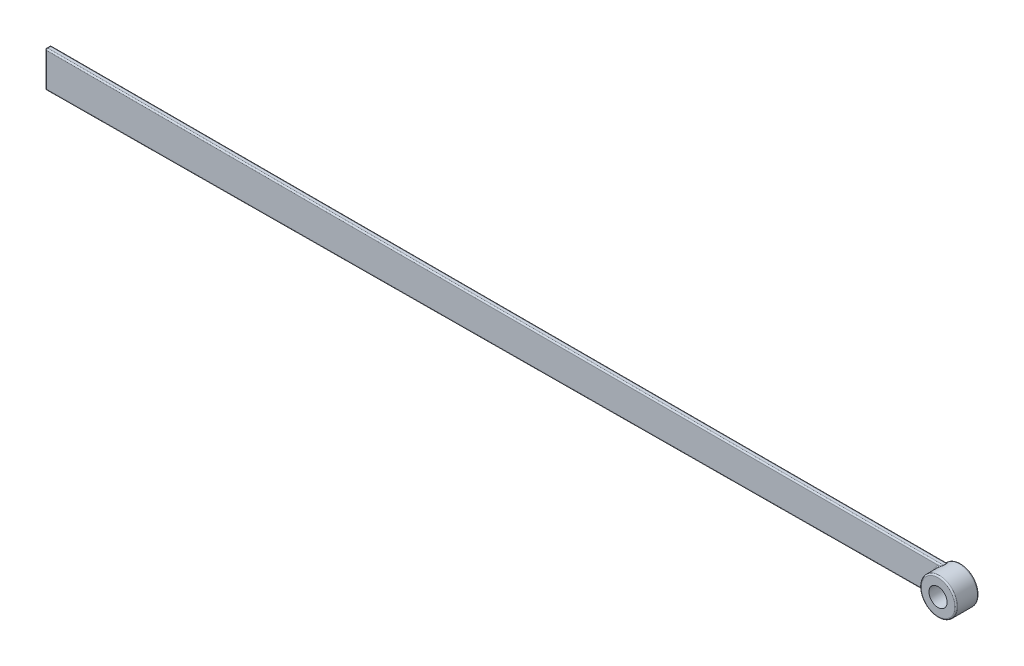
ISO-10303-21;
HEADER;
FILE_DESCRIPTION(('STEP AP214'),'2;1');
FILE_NAME('part.step','',(''),(''),'','','');
FILE_SCHEMA(('AUTOMOTIVE_DESIGN { 1 0 10303 214 1 1 1 1 }'));
ENDSEC;
DATA;
#1=APPLICATION_CONTEXT('core data for automotive mechanical design processes');
#2=APPLICATION_PROTOCOL_DEFINITION('international standard','automotive_design',2000,#1);
#3=PRODUCT_CONTEXT('',#1,'mechanical');
#4=PRODUCT('Part','Part','',(#3));
#5=PRODUCT_RELATED_PRODUCT_CATEGORY('part','',(#4));
#6=PRODUCT_DEFINITION_FORMATION('','',#4);
#7=PRODUCT_DEFINITION_CONTEXT('part definition',#1,'design');
#8=PRODUCT_DEFINITION('design','',#6,#7);
#9=PRODUCT_DEFINITION_SHAPE('','',#8);
#10=(LENGTH_UNIT() NAMED_UNIT(*) SI_UNIT(.MILLI.,.METRE.));
#11=(NAMED_UNIT(*) PLANE_ANGLE_UNIT() SI_UNIT($,.RADIAN.));
#12=(NAMED_UNIT(*) SI_UNIT($,.STERADIAN.) SOLID_ANGLE_UNIT());
#13=UNCERTAINTY_MEASURE_WITH_UNIT(LENGTH_MEASURE(1.E-05),#10,'distance_accuracy_value','');
#14=(GEOMETRIC_REPRESENTATION_CONTEXT(3) GLOBAL_UNCERTAINTY_ASSIGNED_CONTEXT((#13)) GLOBAL_UNIT_ASSIGNED_CONTEXT((#10,
#11,#12)) REPRESENTATION_CONTEXT('',''));
#15=CARTESIAN_POINT('',(0.,0.,0.));
#16=DIRECTION('',(0.,0.,1.));
#17=DIRECTION('',(1.,0.,0.));
#18=AXIS2_PLACEMENT_3D('',#15,#16,#17);
#19=CARTESIAN_POINT('',(0.,0.,25.));
#20=DIRECTION('',(0.,0.,-1.));
#21=DIRECTION('',(-1.,0.,0.));
#22=AXIS2_PLACEMENT_3D('',#19,#20,#21);
#23=CYLINDRICAL_SURFACE('',#22,40.);
#24=CARTESIAN_POINT('',(0.,0.,-22.));
#25=DIRECTION('',(0.,0.,1.));
#26=DIRECTION('',(1.,0.,0.));
#27=AXIS2_PLACEMENT_3D('',#24,#25,#26);
#28=CIRCLE('',#27,40.);
#29=CARTESIAN_POINT('',(40.,0.,-22.));
#30=VERTEX_POINT('',#29);
#31=EDGE_CURVE('E236',#30,#30,#28,.T.);
#32=ORIENTED_EDGE('',*,*,#31,.T.);
#33=EDGE_LOOP('',(#32));
#34=FACE_BOUND('',#33,.T.);
#35=CARTESIAN_POINT('',(0.,0.,22.));
#36=DIRECTION('',(0.,0.,1.));
#37=DIRECTION('',(1.,0.,0.));
#38=AXIS2_PLACEMENT_3D('',#35,#36,#37);
#39=CIRCLE('',#38,40.);
#40=CARTESIAN_POINT('',(40.,0.,22.));
#41=VERTEX_POINT('',#40);
#42=EDGE_CURVE('E233',#41,#41,#39,.F.);
#43=ORIENTED_EDGE('',*,*,#42,.T.);
#44=EDGE_LOOP('',(#43));
#45=FACE_BOUND('',#44,.T.);
#46=DIRECTION('',(0.,0.,-1.));
#47=VECTOR('',#46,1.);
#48=CARTESIAN_POINT('',(-22.7657159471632,-32.8895451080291,25.));
#49=LINE('',#48,#47);
#50=CARTESIAN_POINT('',(-22.7657159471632,-32.8895451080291,-7.));
#51=VERTEX_POINT('',#50);
#52=CARTESIAN_POINT('',(-22.7657159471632,-32.8895451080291,-13.));
#53=VERTEX_POINT('',#52);
#54=EDGE_CURVE('E225',#51,#53,#49,.T.);
#55=ORIENTED_EDGE('',*,*,#54,.T.);
#56=CARTESIAN_POINT('',(-22.9622795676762,-32.7526138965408,-11.6731450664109));
#57=CARTESIAN_POINT('',(-23.7354289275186,-32.2105725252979,-12.0427545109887));
#58=CARTESIAN_POINT('',(-24.7031828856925,-32.2833953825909,-12.3365725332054));
#59=CARTESIAN_POINT('',(-22.930738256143,-32.7747243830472,-11.7788249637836));
#60=CARTESIAN_POINT('',(-23.7049210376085,-32.2330682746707,-12.1181232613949));
#61=CARTESIAN_POINT('',(-24.6693527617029,-32.2951717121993,-12.3894124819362));
#62=CARTESIAN_POINT('',(-22.9025813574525,-32.7943990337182,-11.8863202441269));
#63=CARTESIAN_POINT('',(-23.6776284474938,-32.2531294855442,-12.1951927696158));
#64=CARTESIAN_POINT('',(-24.639152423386,-32.3056503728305,-12.4431601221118));
#65=CARTESIAN_POINT('',(-22.8536570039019,-32.8285135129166,-12.1042698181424));
#66=CARTESIAN_POINT('',(-23.6302008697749,-32.2879192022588,-12.3518689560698));
#67=CARTESIAN_POINT('',(-24.5866772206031,-32.3238192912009,-12.5521349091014));
#68=CARTESIAN_POINT('',(-22.8328960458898,-32.8429487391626,-12.2147266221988));
#69=CARTESIAN_POINT('',(-23.6100485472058,-32.3026604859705,-12.4315131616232));
#70=CARTESIAN_POINT('',(-24.5644093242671,-32.33150709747,-12.6073633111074));
#71=CARTESIAN_POINT('',(-22.7995309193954,-32.8661191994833,-12.4371450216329));
#72=CARTESIAN_POINT('',(-23.5776691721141,-32.3263170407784,-12.5921635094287));
#73=CARTESIAN_POINT('',(-24.5286222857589,-32.3438469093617,-12.7185725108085));
#74=CARTESIAN_POINT('',(-22.7868838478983,-32.8748844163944,-12.5490954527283));
#75=CARTESIAN_POINT('',(-23.565383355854,-32.3352754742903,-12.6732003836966));
#76=CARTESIAN_POINT('',(-24.5150571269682,-32.3485148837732,-12.7745477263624));
#77=CARTESIAN_POINT('',(-22.7699781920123,-32.8865961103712,-12.7740320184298));
#78=CARTESIAN_POINT('',(-23.5489677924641,-32.3472401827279,-12.8361372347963));
#79=CARTESIAN_POINT('',(-24.4969242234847,-32.3547519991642,-12.8870160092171));
#80=CARTESIAN_POINT('',(-22.7657158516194,-32.8895451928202,-12.8870176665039));
#81=CARTESIAN_POINT('',(-23.5448253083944,-32.3502557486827,-12.9180813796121));
#82=CARTESIAN_POINT('',(-24.4923524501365,-32.3563225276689,-12.943508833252));
#83=CARTESIAN_POINT('',(-22.7657160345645,-32.8895450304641,-13.1033535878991));
#84=CARTESIAN_POINT('',(-23.5448254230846,-32.3502556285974,-13.0749372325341));
#85=CARTESIAN_POINT('',(-24.4923526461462,-32.3563224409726,-13.0516767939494));
#86=CARTESIAN_POINT('',(-22.7692829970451,-32.8870770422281,-13.2067044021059));
#87=CARTESIAN_POINT('',(-23.548291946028,-32.3477321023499,-13.149889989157));
#88=CARTESIAN_POINT('',(-24.4961785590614,-32.3550081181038,-13.1033522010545));
#89=CARTESIAN_POINT('',(-22.7834355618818,-32.8772737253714,-13.4125940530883));
#90=CARTESIAN_POINT('',(-23.5620343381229,-32.3377169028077,-13.2990537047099));
#91=CARTESIAN_POINT('',(-24.5113585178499,-32.3497873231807,-13.2062970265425));
#92=CARTESIAN_POINT('',(-22.7940236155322,-32.8699366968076,-13.5151325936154));
#93=CARTESIAN_POINT('',(-23.572318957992,-32.3302188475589,-13.3732986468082));
#94=CARTESIAN_POINT('',(-24.5227151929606,-32.3458799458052,-13.2575662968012));
#95=CARTESIAN_POINT('',(-22.8359226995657,-32.8408566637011,-13.8201924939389));
#96=CARTESIAN_POINT('',(-23.6130066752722,-32.3005090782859,-13.5938762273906));
#97=CARTESIAN_POINT('',(-24.567655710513,-32.3303929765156,-13.4100962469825));
#98=CARTESIAN_POINT('',(-22.877369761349,-32.8120440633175,-14.0204311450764));
#99=CARTESIAN_POINT('',(-23.6532847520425,-32.2710517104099,-13.7382370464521));
#100=CARTESIAN_POINT('',(-24.612111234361,-32.3150482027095,-13.51021557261));
#101=CARTESIAN_POINT('',(-22.9959176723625,-32.7291009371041,-14.4556448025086));
#102=CARTESIAN_POINT('',(-23.7681563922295,-32.1865075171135,-14.0499172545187));
#103=CARTESIAN_POINT('',(-24.7392621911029,-32.2708724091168,-13.7278224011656));
#104=CARTESIAN_POINT('',(-23.0791223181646,-32.6706016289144,-14.6876727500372));
#105=CARTESIAN_POINT('',(-23.848821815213,-32.1268510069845,-14.2147749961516));
#106=CARTESIAN_POINT('',(-24.8285040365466,-32.2397140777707,-13.8438363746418));
#107=CARTESIAN_POINT('',(-23.2722136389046,-32.5333373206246,-15.1313276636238));
#108=CARTESIAN_POINT('',(-24.0350711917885,-31.9876209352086,-14.5259166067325));
#109=CARTESIAN_POINT('',(-25.0356005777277,-32.1665959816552,-14.0656638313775));
#110=CARTESIAN_POINT('',(-23.3821716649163,-32.4545180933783,-15.3428979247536));
#111=CARTESIAN_POINT('',(-24.141067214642,-31.9077272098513,-14.6723228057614));
#112=CARTESIAN_POINT('',(-25.153531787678,-32.1246073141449,-14.1714489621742));
#113=CARTESIAN_POINT('',(-23.5918663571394,-32.3022654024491,-15.695611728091));
#114=CARTESIAN_POINT('',(-24.3419272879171,-31.7544424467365,-14.911926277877));
#115=CARTESIAN_POINT('',(-25.3784250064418,-32.043489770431,-14.3478058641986));
#116=CARTESIAN_POINT('',(-23.6875451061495,-32.2322145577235,-15.8413392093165));
#117=CARTESIAN_POINT('',(-24.4335081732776,-31.6839755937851,-15.0095967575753));
#118=CARTESIAN_POINT('',(-25.4810364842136,-32.0061651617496,-14.4206696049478));
#119=CARTESIAN_POINT('',(-23.8873476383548,-32.0844207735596,-16.1212254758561));
#120=CARTESIAN_POINT('',(-24.6240041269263,-31.5359430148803,-15.1941166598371));
#121=CARTESIAN_POINT('',(-25.695311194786,-31.9274103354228,-14.5606127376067));
#122=CARTESIAN_POINT('',(-23.991475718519,-32.0066739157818,-16.2553783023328));
#123=CARTESIAN_POINT('',(-24.7230471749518,-31.4582668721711,-15.2809496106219));
#124=CARTESIAN_POINT('',(-25.8069790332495,-31.8859780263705,-14.6276891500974));
#125=CARTESIAN_POINT('',(-24.2063270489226,-31.844495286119,-16.5128007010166));
#126=CARTESIAN_POINT('',(-24.9265328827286,-31.297003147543,-15.4442016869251));
#127=CARTESIAN_POINT('',(-26.03738136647,-31.799542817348,-14.7564003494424));
#128=CARTESIAN_POINT('',(-24.3170596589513,-31.7600539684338,-16.6360541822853));
#129=CARTESIAN_POINT('',(-25.0310904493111,-31.2133088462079,-15.5205715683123));
#130=CARTESIAN_POINT('',(-26.1561258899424,-31.7545348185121,-14.8180270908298));
#131=CARTESIAN_POINT('',(-24.5435197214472,-31.5853782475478,-16.872106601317));
#132=CARTESIAN_POINT('',(-25.2439209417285,-31.0410864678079,-15.6631559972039));
#133=CARTESIAN_POINT('',(-26.3989643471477,-31.6614220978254,-14.9360533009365));
#134=CARTESIAN_POINT('',(-24.6592487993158,-31.495141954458,-16.9849020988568));
#135=CARTESIAN_POINT('',(-25.3522878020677,-30.9524656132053,-15.729317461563));
#136=CARTESIAN_POINT('',(-26.5230600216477,-31.6133163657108,-14.9924510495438));
#137=CARTESIAN_POINT('',(-24.9578210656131,-31.2595615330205,-17.2585917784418));
#138=CARTESIAN_POINT('',(-25.6311192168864,-30.7218730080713,-15.8851555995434));
#139=CARTESIAN_POINT('',(-26.8432079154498,-31.4877141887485,-15.1292958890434));
#140=CARTESIAN_POINT('',(-25.1432732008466,-31.1106887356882,-17.4127133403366));
#141=CARTESIAN_POINT('',(-25.8027774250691,-30.577493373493,-15.9675349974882));
#142=CARTESIAN_POINT('',(-27.0420525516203,-31.4083299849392,-15.2063566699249));
#143=CARTESIAN_POINT('',(-25.5200397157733,-30.8023852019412,-17.6989664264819));
#144=CARTESIAN_POINT('',(-26.148153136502,-30.2818221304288,-16.1100019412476));
#145=CARTESIAN_POINT('',(-27.4460072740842,-31.2439066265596,-15.3494832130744));
#146=CARTESIAN_POINT('',(-25.711356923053,-30.6429493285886,-17.8310871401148));
#147=CARTESIAN_POINT('',(-26.32208340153,-30.1302622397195,-16.1697901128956));
#148=CARTESIAN_POINT('',(-27.6511203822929,-31.1588647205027,-15.4155435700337));
#149=CARTESIAN_POINT('',(-26.0976948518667,-30.3145945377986,-18.0742901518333));
#150=CARTESIAN_POINT('',(-26.6693397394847,-29.8222484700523,-16.267597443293));
#151=CARTESIAN_POINT('',(-28.065295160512,-30.9836963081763,-15.5371450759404));
#152=CARTESIAN_POINT('',(-26.292718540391,-30.1456677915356,-18.1853547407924));
#153=CARTESIAN_POINT('',(-26.8428123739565,-29.6655639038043,-16.3052573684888));
#154=CARTESIAN_POINT('',(-28.2743599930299,-30.8935656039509,-15.5926773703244));
#155=CARTESIAN_POINT('',(-26.6845499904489,-29.7993822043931,-18.3867034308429));
#156=CARTESIAN_POINT('',(-27.1866525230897,-29.3494785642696,-16.3589419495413));
#157=CARTESIAN_POINT('',(-28.694378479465,-30.7087778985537,-15.6933517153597));
#158=CARTESIAN_POINT('',(-26.8813578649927,-29.6220228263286,-18.4769862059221));
#159=CARTESIAN_POINT('',(-27.3571053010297,-29.1898926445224,-16.3745745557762));
#160=CARTESIAN_POINT('',(-28.905332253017,-30.6141206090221,-15.7384931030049));
#161=CARTESIAN_POINT('',(-27.2815482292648,-29.2539457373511,-18.6392480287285));
#162=CARTESIAN_POINT('',(-27.6981960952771,-28.8650039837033,-16.384374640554));
#163=CARTESIAN_POINT('',(-29.3342613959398,-30.4176482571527,-15.8196240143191));
#164=CARTESIAN_POINT('',(-27.4849411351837,-29.0629827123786,-18.7105551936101));
#165=CARTESIAN_POINT('',(-27.8685772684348,-28.6996442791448,-16.3773659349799));
#166=CARTESIAN_POINT('',(-29.5522471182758,-30.3157013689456,-15.8552775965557));
#167=CARTESIAN_POINT('',(-27.8906241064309,-28.6738926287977,-18.8304743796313));
#168=CARTESIAN_POINT('',(-28.2014629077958,-28.371055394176,-16.340315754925));
#169=CARTESIAN_POINT('',(-29.9870083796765,-30.1079529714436,-15.9152371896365));
#170=CARTESIAN_POINT('',(-28.0929142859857,-28.4757663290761,-18.8790887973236));
#171=CARTESIAN_POINT('',(-28.3639074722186,-28.207758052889,-16.3097417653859));
#172=CARTESIAN_POINT('',(-30.2037840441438,-30.0021518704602,-15.939544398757));
#173=CARTESIAN_POINT('',(-28.4942350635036,-28.0741632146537,-18.9526037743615));
#174=CARTESIAN_POINT('',(-28.6779511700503,-27.8870874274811,-16.2257994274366));
#175=CARTESIAN_POINT('',(-30.6338129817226,-29.7876624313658,-15.976301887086));
#176=CARTESIAN_POINT('',(-28.6932757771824,-27.8707123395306,-18.9776029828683));
#177=CARTESIAN_POINT('',(-28.829455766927,-27.729709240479,-16.1719503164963));
#178=CARTESIAN_POINT('',(-30.8470772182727,-29.6789880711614,-15.9888014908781));
#179=CARTESIAN_POINT('',(-29.0876988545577,-27.4588364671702,-19.0029634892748));
#180=CARTESIAN_POINT('',(-29.1202232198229,-27.4236304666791,-16.0420229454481));
#181=CARTESIAN_POINT('',(-31.2696559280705,-29.4589530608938,-16.0014817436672));
#182=CARTESIAN_POINT('',(-29.2830795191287,-27.2504092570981,-19.0033136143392));
#183=CARTESIAN_POINT('',(-29.2592242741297,-27.2750962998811,-15.9653432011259));
#184=CARTESIAN_POINT('',(-31.4789685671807,-29.3475912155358,-16.0016568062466));
#185=CARTESIAN_POINT('',(-29.4759076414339,-27.0401713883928,-18.9906890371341));
#186=CARTESIAN_POINT('',(-29.3889461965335,-27.1349661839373,-15.8790230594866));
#187=CARTESIAN_POINT('',(-31.685531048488,-29.2352473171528,-15.995344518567));
#188=(BOUNDED_SURFACE() B_SPLINE_SURFACE(3,2,((#56,#57,#58),(#59,#60,#61),(#62,#63,#64),(#65,
#66,#67),(#68,#69,#70),(#71,#72,#73),(#74,#75,#76),(#77,#78,#79),(#80,#81,#82),(#83,#84,#85),
(#86,#87,#88),(#89,#90,#91),(#92,#93,#94),(#95,#96,#97),(#98,#99,#100),(#101,#102,#103),(#104,
#105,#106),(#107,#108,#109),(#110,#111,#112),(#113,#114,#115),(#116,#117,#118),(#119,#120,#121),
(#122,#123,#124),(#125,#126,#127),(#128,#129,#130),(#131,#132,#133),(#134,#135,#136),(#137,#138,
#139),(#140,#141,#142),(#143,#144,#145),(#146,#147,#148),(#149,#150,#151),(#152,#153,#154),
(#155,#156,#157),(#158,#159,#160),(#161,#162,#163),(#164,#165,#166),(#167,#168,#169),(#170,#171,
#172),(#173,#174,#175),(#176,#177,#178),(#179,#180,#181),(#182,#183,#184),(#185,#186,#187)),
.UNSPECIFIED.,.F.,.F.,.F.) B_SPLINE_SURFACE_WITH_KNOTS((4,2,2,2,2,2,2,2,2,2,2,2,2,2,2,2,2,2,2,2,
2,4),(3,3),(0.,0.340489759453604,0.681277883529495,1.02024887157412,1.35906798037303,
1.66901175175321,1.97906379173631,2.59836037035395,3.36373161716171,4.13116692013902,
4.71125143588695,5.29163282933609,5.87285722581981,6.45427214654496,7.34850204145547,
8.24317004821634,9.13858720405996,10.0340614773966,10.9579569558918,11.8817548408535,
12.801676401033,13.722014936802),(0.,1.),
.UNSPECIFIED.) GEOMETRIC_REPRESENTATION_ITEM() RATIONAL_B_SPLINE_SURFACE(((1.,0.947349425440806,
1.),(1.,0.94835288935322,1.),(1.,0.949245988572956,1.),(1.,0.950794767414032,1.),(1.,
0.951450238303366,1.),(1.,0.952502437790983,1.),(1.,0.952900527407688,1.),(1.,0.953432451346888,
1.),(1.,0.953566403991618,1.),(1.,0.953566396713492,1.),(1.,0.95345429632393,1.),(1.,
0.953009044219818,1.),(1.,0.952675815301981,1.),(1.,0.951355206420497,1.),(1.,0.95004687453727,
1.),(1.,0.946282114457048,1.),(1.,0.943627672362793,1.),(1.,0.937403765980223,1.),(1.,
0.933831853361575,1.),(1.,0.926938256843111,1.),(1.,0.923768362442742,1.),(1.,0.917085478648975,
1.),(1.,0.913572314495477,1.),(1.,0.906249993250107,1.),(1.,0.902440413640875,1.),(1.,
0.894567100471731,1.),(1.,0.890503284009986,1.),(1.,0.879904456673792,1.),(1.,0.873216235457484,
1.),(1.,0.859389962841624,1.),(1.,0.852251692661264,1.),(1.,0.83757997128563,1.),(1.,
0.830046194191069,1.),(1.,0.814637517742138,1.),(1.,0.806762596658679,1.),(1.,0.790461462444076,
1.),(1.,0.7820256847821,1.),(1.,0.764889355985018,1.),(1.,0.756188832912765,1.),(1.,
0.738613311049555,1.),(1.,0.729739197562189,1.),(1.,0.711844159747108,1.),(1.,0.702823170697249,
1.),(1.,0.693764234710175,1.))) REPRESENTATION_ITEM('') SURFACE());
#189=CARTESIAN_POINT('',(-29.4759076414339,-27.0401713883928,-18.9906890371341));
#190=CARTESIAN_POINT('',(-29.2830795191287,-27.2504092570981,-19.0033136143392));
#191=CARTESIAN_POINT('',(-29.0876988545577,-27.4588364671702,-19.0029634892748));
#192=CARTESIAN_POINT('',(-28.6932757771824,-27.8707123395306,-18.9776029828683));
#193=CARTESIAN_POINT('',(-28.4942350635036,-28.0741632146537,-18.9526037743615));
#194=CARTESIAN_POINT('',(-28.0929142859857,-28.4757663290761,-18.8790887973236));
#195=CARTESIAN_POINT('',(-27.8906241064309,-28.6738926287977,-18.8304743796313));
#196=CARTESIAN_POINT('',(-27.4849411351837,-29.0629827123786,-18.7105551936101));
#197=CARTESIAN_POINT('',(-27.2815482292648,-29.2539457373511,-18.6392480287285));
#198=CARTESIAN_POINT('',(-26.8813578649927,-29.6220228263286,-18.4769862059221));
#199=CARTESIAN_POINT('',(-26.6845499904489,-29.7993822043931,-18.3867034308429));
#200=CARTESIAN_POINT('',(-26.292718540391,-30.1456677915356,-18.1853547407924));
#201=CARTESIAN_POINT('',(-26.0976948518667,-30.3145945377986,-18.0742901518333));
#202=CARTESIAN_POINT('',(-25.711356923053,-30.6429493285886,-17.8310871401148));
#203=CARTESIAN_POINT('',(-25.5200397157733,-30.8023852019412,-17.6989664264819));
#204=CARTESIAN_POINT('',(-25.1432732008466,-31.1106887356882,-17.4127133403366));
#205=CARTESIAN_POINT('',(-24.9578210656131,-31.2595615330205,-17.2585917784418));
#206=CARTESIAN_POINT('',(-24.6592487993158,-31.495141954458,-16.9849020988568));
#207=CARTESIAN_POINT('',(-24.5435197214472,-31.5853782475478,-16.872106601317));
#208=CARTESIAN_POINT('',(-24.3170596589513,-31.7600539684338,-16.6360541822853));
#209=CARTESIAN_POINT('',(-24.2063270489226,-31.844495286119,-16.5128007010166));
#210=CARTESIAN_POINT('',(-23.991475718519,-32.0066739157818,-16.2553783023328));
#211=CARTESIAN_POINT('',(-23.8873476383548,-32.0844207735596,-16.1212254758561));
#212=CARTESIAN_POINT('',(-23.6875451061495,-32.2322145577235,-15.8413392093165));
#213=CARTESIAN_POINT('',(-23.5918663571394,-32.3022654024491,-15.695611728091));
#214=CARTESIAN_POINT('',(-23.3821716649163,-32.4545180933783,-15.3428979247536));
#215=CARTESIAN_POINT('',(-23.2722136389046,-32.5333373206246,-15.1313276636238));
#216=CARTESIAN_POINT('',(-23.0791223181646,-32.6706016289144,-14.6876727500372));
#217=CARTESIAN_POINT('',(-22.9959176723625,-32.7291009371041,-14.4556448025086));
#218=CARTESIAN_POINT('',(-22.877369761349,-32.8120440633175,-14.0204311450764));
#219=CARTESIAN_POINT('',(-22.8359226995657,-32.8408566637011,-13.8201924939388));
#220=CARTESIAN_POINT('',(-22.7940236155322,-32.8699366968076,-13.5151325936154));
#221=CARTESIAN_POINT('',(-22.7834355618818,-32.8772737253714,-13.4125940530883));
#222=CARTESIAN_POINT('',(-22.7692829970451,-32.8870770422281,-13.2067044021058));
#223=CARTESIAN_POINT('',(-22.7657160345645,-32.8895450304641,-13.1033535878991));
#224=CARTESIAN_POINT('',(-22.7657158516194,-32.8895451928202,-12.8870176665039));
#225=CARTESIAN_POINT('',(-22.7699781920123,-32.8865961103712,-12.7740320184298));
#226=CARTESIAN_POINT('',(-22.7868838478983,-32.8748844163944,-12.5490954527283));
#227=CARTESIAN_POINT('',(-22.7995309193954,-32.8661191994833,-12.4371450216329));
#228=CARTESIAN_POINT('',(-22.8328960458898,-32.8429487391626,-12.2147266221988));
#229=CARTESIAN_POINT('',(-22.8536570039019,-32.8285135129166,-12.1042698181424));
#230=CARTESIAN_POINT('',(-22.9025813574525,-32.7943990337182,-11.8863202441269));
#231=CARTESIAN_POINT('',(-22.930738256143,-32.7747243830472,-11.7788249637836));
#232=CARTESIAN_POINT('',(-22.9622795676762,-32.7526138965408,-11.6731450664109));
#233=B_SPLINE_CURVE_WITH_KNOTS('',3,(#189,#190,#191,#192,#193,#194,#195,#196,#197,#198,#199,
#200,#201,#202,#203,#204,#205,#206,#207,#208,#209,#210,#211,#212,#213,#214,#215,#216,#217,#218,
#219,#220,#221,#222,#223,#224,#225,#226,#227,#228,#229,#230,#231,#232),.UNSPECIFIED.,.F.,.F.,(4,
2,2,2,2,2,2,2,2,2,2,2,2,2,2,2,2,2,2,2,2,4),(0.,0.920338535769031,1.84026009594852,
2.76405798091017,3.68795345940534,4.58342773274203,5.47884488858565,6.37351289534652,
7.26774279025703,7.84915771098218,8.4303821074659,9.01076350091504,9.59084801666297,
10.3582833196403,11.123654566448,11.7429511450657,12.0530031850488,12.362946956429,
12.7017660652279,13.0407370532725,13.3815251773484,13.722014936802),.UNSPECIFIED.);
#234=CARTESIAN_POINT('',(-29.1894360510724,-27.3491649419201,-19.));
#235=VERTEX_POINT('',#234);
#236=EDGE_CURVE('E11',#53,#235,#233,.F.);
#237=ORIENTED_EDGE('',*,*,#236,.T.);
#238=CARTESIAN_POINT('',(0.,0.,-19.));
#239=DIRECTION('',(0.,0.,-1.));
#240=DIRECTION('',(-1.,0.,0.));
#241=AXIS2_PLACEMENT_3D('',#238,#239,#240);
#242=CIRCLE('',#241,40.);
#243=CARTESIAN_POINT('',(-26.7241173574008,29.7627544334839,-19.));
#244=VERTEX_POINT('',#243);
#245=EDGE_CURVE('E227',#235,#244,#242,.T.);
#246=ORIENTED_EDGE('',*,*,#245,.T.);
#247=CARTESIAN_POINT('',(-29.2102986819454,27.3268814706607,-18.3984373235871));
#248=CARTESIAN_POINT('',(-28.2796239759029,28.3216999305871,-14.5525479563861));
#249=CARTESIAN_POINT('',(-31.4010710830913,30.6856792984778,-15.6992186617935));
#250=CARTESIAN_POINT('',(-29.0576797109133,27.4900479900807,-18.4834860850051));
#251=CARTESIAN_POINT('',(-28.2137146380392,28.3811597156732,-14.675188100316));
#252=CARTESIAN_POINT('',(-31.2370056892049,30.7733813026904,-15.7417430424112));
#253=CARTESIAN_POINT('',(-28.9015130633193,27.6542107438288,-18.5585648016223));
#254=CARTESIAN_POINT('',(-28.1381005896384,28.4512198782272,-14.795997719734));
#255=CARTESIAN_POINT('',(-31.0691265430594,30.8616187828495,-15.7792824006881));
#256=CARTESIAN_POINT('',(-28.5832266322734,27.9830492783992,-18.6899332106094));
#257=CARTESIAN_POINT('',(-27.9704503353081,28.6081313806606,-15.0273270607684));
#258=CARTESIAN_POINT('',(-30.7269686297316,31.0383694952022,-15.8449666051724));
#259=CARTESIAN_POINT('',(-28.4211112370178,28.1477246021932,-18.7462364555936));
#260=CARTESIAN_POINT('',(-27.8788399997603,28.6945482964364,-15.1380900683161));
#261=CARTESIAN_POINT('',(-30.5526945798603,31.126882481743,-15.8731182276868));
#262=CARTESIAN_POINT('',(-28.0928329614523,28.4753635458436,-18.8410394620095));
#263=CARTESIAN_POINT('',(-27.6815387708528,28.8804009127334,-15.3463536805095));
#264=CARTESIAN_POINT('',(-30.1997954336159,31.3029884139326,-15.9205197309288));
#265=CARTESIAN_POINT('',(-27.9267001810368,28.6383315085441,-18.879643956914));
#266=CARTESIAN_POINT('',(-27.5762821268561,28.9794347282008,-15.4442195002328));
#267=CARTESIAN_POINT('',(-30.0212026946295,31.3905836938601,-15.9398219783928));
#268=CARTESIAN_POINT('',(-27.5902882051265,28.9625712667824,-18.9406538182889));
#269=CARTESIAN_POINT('',(-27.3531341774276,29.1878593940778,-15.6261623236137));
#270=CARTESIAN_POINT('',(-29.6595598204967,31.5648625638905,-15.9703269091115));
#271=CARTESIAN_POINT('',(-27.4200091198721,29.1238431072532,-18.9630596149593));
#272=CARTESIAN_POINT('',(-27.2355029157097,29.2970399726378,-15.710571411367));
#273=CARTESIAN_POINT('',(-29.4765098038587,31.6515461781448,-15.9815298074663));
#274=CARTESIAN_POINT('',(-27.0750132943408,29.4448561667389,-18.9927776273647));
#275=CARTESIAN_POINT('',(-26.9885995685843,29.5237688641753,-15.8653936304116));
#276=CARTESIAN_POINT('',(-29.1056392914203,31.8240906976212,-15.9963888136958));
#277=CARTESIAN_POINT('',(-26.9002760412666,29.6045823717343,-18.9999983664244));
#278=CARTESIAN_POINT('',(-26.8594430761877,29.6412478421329,-15.9360719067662));
#279=CARTESIAN_POINT('',(-28.9177967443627,31.9099435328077,-15.9999991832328));
#280=CARTESIAN_POINT('',(-26.4534860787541,30.0057529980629,-19.0000025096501));
#281=CARTESIAN_POINT('',(-26.5216881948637,29.9445120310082,-16.0956278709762));
#282=CARTESIAN_POINT('',(-28.437497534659,32.125572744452,-16.0000012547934));
#283=CARTESIAN_POINT('',(-26.1794999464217,30.2450834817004,-18.9829665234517));
#284=CARTESIAN_POINT('',(-26.3051213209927,30.1355802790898,-16.1763030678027));
#285=CARTESIAN_POINT('',(-28.142962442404,32.2542128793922,-15.991483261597));
#286=CARTESIAN_POINT('',(-25.6268457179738,30.71476026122,-18.9175592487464));
#287=CARTESIAN_POINT('',(-25.8544635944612,30.523984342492,-16.3027115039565));
#288=CARTESIAN_POINT('',(-27.5488591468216,32.5066641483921,-15.9587796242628));
#289=CARTESIAN_POINT('',(-25.348173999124,30.9450991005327,-18.8691625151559));
#290=CARTESIAN_POINT('',(-25.6206037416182,30.7213707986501,-16.3495064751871));
#291=CARTESIAN_POINT('',(-27.2492870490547,32.6304712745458,-15.9345812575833));
#292=CARTESIAN_POINT('',(-24.7871051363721,31.3963300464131,-18.7427529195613));
#293=CARTESIAN_POINT('',(-25.139029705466,31.1178234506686,-16.40944852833));
#294=CARTESIAN_POINT('',(-26.6461380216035,32.8730079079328,-15.8713764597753));
#295=CARTESIAN_POINT('',(-24.5046974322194,31.6171797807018,-18.6646200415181));
#296=CARTESIAN_POINT('',(-24.8912872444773,31.3171357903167,-16.4234096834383));
#297=CARTESIAN_POINT('',(-26.3425497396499,32.9917146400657,-15.8323100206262));
#298=CARTESIAN_POINT('',(-23.9393307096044,32.0473797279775,-18.4799810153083));
#299=CARTESIAN_POINT('',(-24.3869318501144,31.712519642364,-16.4185742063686));
#300=CARTESIAN_POINT('',(-25.7347805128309,33.2229471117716,-15.7399905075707));
#301=CARTESIAN_POINT('',(-23.6563719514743,32.2567344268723,-18.3734860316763));
#302=CARTESIAN_POINT('',(-24.1302178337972,31.9089250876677,-16.400592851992));
#303=CARTESIAN_POINT('',(-25.4305998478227,33.3354752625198,-15.6867430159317));
#304=CARTESIAN_POINT('',(-23.138224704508,32.6298508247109,-18.1520873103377));
#305=CARTESIAN_POINT('',(-23.6533241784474,32.264331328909,-16.3382172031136));
#306=CARTESIAN_POINT('',(-24.8735915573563,33.5360253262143,-15.5760436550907));
#307=CARTESIAN_POINT('',(-22.9027990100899,32.7954658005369,-18.0414140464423));
#308=CARTESIAN_POINT('',(-23.4346390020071,32.423895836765,-16.2991594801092));
#309=CARTESIAN_POINT('',(-24.6205089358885,33.6250433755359,-15.5207070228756));
#310=CARTESIAN_POINT('',(-22.4346372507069,33.117483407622,-17.7998866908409));
#311=CARTESIAN_POINT('',(-22.9961332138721,32.7369143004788,-16.1989444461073));
#312=CARTESIAN_POINT('',(-24.1172350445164,33.7981278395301,-15.3999433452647));
#313=CARTESIAN_POINT('',(-22.2019007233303,33.2738876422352,-17.6690361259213));
#314=CARTESIAN_POINT('',(-22.7761167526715,32.8906297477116,-16.1381263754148));
#315=CARTESIAN_POINT('',(-23.8670432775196,33.8821951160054,-15.3345180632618));
#316=CARTESIAN_POINT('',(-21.7422152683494,33.5760538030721,-17.3865602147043));
#317=CARTESIAN_POINT('',(-22.3386801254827,33.1896661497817,-15.9942542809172));
#318=CARTESIAN_POINT('',(-23.3728814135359,34.0446094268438,-15.1932801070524));
#319=CARTESIAN_POINT('',(-21.5152453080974,33.7218597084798,-17.2350292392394));
#320=CARTESIAN_POINT('',(-22.1210145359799,33.3352887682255,-15.9115865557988));
#321=CARTESIAN_POINT('',(-23.1288887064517,34.1229801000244,-15.1175146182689));
#322=CARTESIAN_POINT('',(-21.0691779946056,34.002337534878,-16.9087187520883));
#323=CARTESIAN_POINT('',(-21.6910447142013,33.6168983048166,-15.7227807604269));
#324=CARTESIAN_POINT('',(-22.6493663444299,34.2737369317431,-14.9543593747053));
#325=CARTESIAN_POINT('',(-20.8500739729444,34.1370190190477,-16.7339595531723));
#326=CARTESIAN_POINT('',(-21.4784198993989,33.7531891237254,-15.6168980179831));
#327=CARTESIAN_POINT('',(-22.4138295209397,34.3461282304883,-14.8669797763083));
#328=CARTESIAN_POINT('',(-20.4588450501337,34.3726503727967,-16.3881889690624));
#329=CARTESIAN_POINT('',(-21.0969301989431,33.9928079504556,-15.3984935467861));
#330=CARTESIAN_POINT('',(-21.9932584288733,34.472780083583,-14.6940944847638));
#331=CARTESIAN_POINT('',(-20.2848579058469,34.4755309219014,-16.2211528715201));
#332=CARTESIAN_POINT('',(-20.9266294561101,34.0978990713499,-15.2901335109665));
#333=CARTESIAN_POINT('',(-21.8062222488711,34.5280783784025,-14.6105764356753));
#334=CARTESIAN_POINT('',(-19.94973111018,34.6705307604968,-15.8649859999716));
#335=CARTESIAN_POINT('',(-20.597806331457,34.2975876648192,-15.0532053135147));
#336=CARTESIAN_POINT('',(-21.4459609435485,34.6328907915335,-14.4324929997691));
#337=CARTESIAN_POINT('',(-19.7886155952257,34.7626299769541,-15.6758152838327));
#338=CARTESIAN_POINT('',(-20.4390041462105,34.3923816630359,-14.9246640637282));
#339=CARTESIAN_POINT('',(-21.2727617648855,34.6823941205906,-14.337907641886));
#340=CARTESIAN_POINT('',(-19.5615199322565,34.890610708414,-15.3718082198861));
#341=CARTESIAN_POINT('',(-20.2143860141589,34.5245747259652,-14.7137636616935));
#342=CARTESIAN_POINT('',(-21.0286339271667,34.7511837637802,-14.1859041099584));
#343=CARTESIAN_POINT('',(-19.4877829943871,34.9318305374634,-15.266278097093));
#344=CARTESIAN_POINT('',(-20.1414734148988,34.567146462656,-14.640082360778));
#345=CARTESIAN_POINT('',(-20.9493667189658,34.7733394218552,-14.1331390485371));
#346=CARTESIAN_POINT('',(-19.3471017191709,35.0099433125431,-15.0483867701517));
#347=CARTESIAN_POINT('',(-20.0022604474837,34.6478875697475,-14.4867926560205));
#348=CARTESIAN_POINT('',(-20.7981343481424,34.8153250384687,-14.0241933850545));
#349=CARTESIAN_POINT('',(-19.2801589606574,35.0468352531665,-14.9360239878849));
#350=CARTESIAN_POINT('',(-19.9359061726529,34.6860902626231,-14.4071727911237));
#351=CARTESIAN_POINT('',(-20.7261708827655,34.8351544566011,-13.968011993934));
#352=CARTESIAN_POINT('',(-19.0925631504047,35.1495967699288,-14.5888694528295));
#353=CARTESIAN_POINT('',(-19.7501647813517,34.7923889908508,-14.1599787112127));
#354=CARTESIAN_POINT('',(-20.524505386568,34.8903887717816,-13.7944347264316));
#355=CARTESIAN_POINT('',(-18.9842945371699,35.2080260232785,-14.3429325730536));
#356=CARTESIAN_POINT('',(-19.6422976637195,34.8532251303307,-13.9823760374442));
#357=CARTESIAN_POINT('',(-20.408116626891,34.9217944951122,-13.6714662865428));
#358=CARTESIAN_POINT('',(-18.8525768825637,35.2786564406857,-13.9298989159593));
#359=CARTESIAN_POINT('',(-19.5111288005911,34.9267318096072,-13.6817418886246));
#360=CARTESIAN_POINT('',(-20.2665201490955,34.9597583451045,-13.4649494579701));
#361=CARTESIAN_POINT('',(-18.8125242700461,35.2999997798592,-13.7706968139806));
#362=CARTESIAN_POINT('',(-19.4711950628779,34.9489723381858,-13.5653909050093));
#363=CARTESIAN_POINT('',(-20.2234635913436,34.9712303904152,-13.3853484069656));
#364=CARTESIAN_POINT('',(-18.7547672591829,35.3307202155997,-13.4465632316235));
#365=CARTESIAN_POINT('',(-19.4136587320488,34.9809574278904,-13.3280195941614));
#366=CARTESIAN_POINT('',(-20.1613748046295,34.9877426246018,-13.2232816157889));
#367=CARTESIAN_POINT('',(-18.7370107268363,35.3401252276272,-13.2816460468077));
#368=CARTESIAN_POINT('',(-19.3959377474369,34.9907681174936,-13.2068814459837));
#369=CARTESIAN_POINT('',(-20.1422865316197,34.9927978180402,-13.1408230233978));
#370=CARTESIAN_POINT('',(-18.7257583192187,35.3460893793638,-12.9502740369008));
#371=CARTESIAN_POINT('',(-19.3847232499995,34.996980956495,-12.9635048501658));
#372=CARTESIAN_POINT('',(-20.130190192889,34.9960035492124,-12.9751370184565));
#373=CARTESIAN_POINT('',(-18.7323043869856,35.3426263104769,-12.7838170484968));
#374=CARTESIAN_POINT('',(-19.3912575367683,34.9933677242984,-12.8411123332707));
#375=CARTESIAN_POINT('',(-20.1372272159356,34.9941421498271,-12.8919085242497));
#376=CARTESIAN_POINT('',(-18.7690122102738,35.3231451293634,-12.4541853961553));
#377=CARTESIAN_POINT('',(-19.427836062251,34.9730778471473,-12.5992685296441));
#378=CARTESIAN_POINT('',(-20.1766881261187,34.9836710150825,-12.7270926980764));
#379=CARTESIAN_POINT('',(-18.7992807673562,35.3070702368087,-12.2910290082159));
#380=CARTESIAN_POINT('',(-19.4580315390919,34.9563171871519,-12.4796881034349));
#381=CARTESIAN_POINT('',(-20.2092268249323,34.975030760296,-12.6455145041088));
#382=CARTESIAN_POINT('',(-18.890433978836,35.2583994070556,-11.9332592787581));
#383=CARTESIAN_POINT('',(-19.5488086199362,34.9056601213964,-12.2184745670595));
#384=CARTESIAN_POINT('',(-20.3072165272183,34.948870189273,-12.466629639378));
#385=CARTESIAN_POINT('',(-18.9570334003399,35.2227038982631,-11.7408277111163));
#386=CARTESIAN_POINT('',(-19.6151782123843,34.8684834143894,-12.078576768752));
#387=CARTESIAN_POINT('',(-20.3788109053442,34.9296838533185,-12.3704138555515));
#388=CARTESIAN_POINT('',(-19.0745505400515,35.1591166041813,-11.4649648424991));
#389=CARTESIAN_POINT('',(-19.7318272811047,34.802529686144,-11.8797516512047));
#390=CARTESIAN_POINT('',(-20.5051418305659,34.8955056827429,-12.2324824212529));
#391=CARTESIAN_POINT('',(-19.1164940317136,35.1363373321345,-11.3754128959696));
#392=CARTESIAN_POINT('',(-19.7734934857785,34.7788848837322,-11.8153793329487));
#393=CARTESIAN_POINT('',(-20.550231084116,34.8832618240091,-12.1877064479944));
#394=CARTESIAN_POINT('',(-19.205336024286,35.0878560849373,-11.2004049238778));
#395=CARTESIAN_POINT('',(-19.8616564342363,34.7286181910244,-11.6901129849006));
#396=CARTESIAN_POINT('',(-20.6457362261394,34.8572031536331,-12.1002024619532));
#397=CARTESIAN_POINT('',(-19.252223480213,35.0621606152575,-11.1149403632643));
#398=CARTESIAN_POINT('',(-19.9081672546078,34.7019882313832,-11.6292009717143));
#399=CARTESIAN_POINT('',(-20.6961402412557,34.8433918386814,-12.0574701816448));
#400=CARTESIAN_POINT('',(-19.3012146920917,35.0351696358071,-11.0313665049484));
#401=CARTESIAN_POINT('',(-19.956643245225,34.6740876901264,-11.5700123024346));
#402=CARTESIAN_POINT('',(-20.7488057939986,34.828884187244,-12.0156832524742));
#403=(BOUNDED_SURFACE() B_SPLINE_SURFACE(3,2,((#247,#248,#249),(#250,#251,#252),(#253,#254,
#255),(#256,#257,#258),(#259,#260,#261),(#262,#263,#264),(#265,#266,#267),(#268,#269,#270),
(#271,#272,#273),(#274,#275,#276),(#277,#278,#279),(#280,#281,#282),(#283,#284,#285),(#286,#287,
#288),(#289,#290,#291),(#292,#293,#294),(#295,#296,#297),(#298,#299,#300),(#301,#302,#303),
(#304,#305,#306),(#307,#308,#309),(#310,#311,#312),(#313,#314,#315),(#316,#317,#318),(#319,#320,
#321),(#322,#323,#324),(#325,#326,#327),(#328,#329,#330),(#331,#332,#333),(#334,#335,#336),
(#337,#338,#339),(#340,#341,#342),(#343,#344,#345),(#346,#347,#348),(#349,#350,#351),(#352,#353,
#354),(#355,#356,#357),(#358,#359,#360),(#361,#362,#363),(#364,#365,#366),(#367,#368,#369),
(#370,#371,#372),(#373,#374,#375),(#376,#377,#378),(#379,#380,#381),(#382,#383,#384),(#385,#386,
#387),(#388,#389,#390),(#391,#392,#393),(#394,#395,#396),(#397,#398,#399),(#400,#401,#402)),
.UNSPECIFIED.,.F.,.F.,.F.) B_SPLINE_SURFACE_WITH_KNOTS((4,2,2,2,2,2,2,2,2,2,2,2,2,2,2,2,2,2,2,2,
2,2,2,2,2,4),(3,3),(0.,0.763946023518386,1.52733941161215,2.28615513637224,3.04495070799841,
3.80830441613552,4.98103905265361,6.1547264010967,7.33320190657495,8.51121419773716,
9.49638203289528,10.4813778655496,11.4620204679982,12.4418110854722,13.2629487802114,
14.0855917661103,14.502852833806,14.9202106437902,15.7504721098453,16.2480607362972,
16.7444836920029,17.2417638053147,17.741295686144,18.3641878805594,18.6736212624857,
18.9823774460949),(0.,1.),
.UNSPECIFIED.) GEOMETRIC_REPRESENTATION_ITEM() RATIONAL_B_SPLINE_SURFACE(((1.,0.592387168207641,
1.),(1.,0.600064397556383,1.),(1.,0.607790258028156,1.),(1.,0.623269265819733,1.),(1.,
0.631022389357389,1.),(1.,0.64645084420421,1.),(1.,0.654126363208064,1.),(1.,0.669399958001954,
1.),(1.,0.676998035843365,1.),(1.,0.692124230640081,1.),(1.,0.699651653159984,1.),(1.,
0.718560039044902,1.),(1.,0.729842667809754,1.),(1.,0.751987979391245,1.),(1.,0.762850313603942,
1.),(1.,0.784132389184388,1.),(1.,0.794550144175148,1.),(1.,0.814845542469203,1.),(1.,
0.82472339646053,1.),(1.,0.842329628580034,1.),(1.,0.850145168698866,1.),(1.,0.865342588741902,
1.),(1.,0.872724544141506,1.),(1.,0.886987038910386,1.),(1.,0.893869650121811,1.),(1.,
0.90711000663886,1.),(1.,0.913468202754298,1.),(1.,0.924592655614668,1.),(1.,0.929449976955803,
1.),(1.,0.938656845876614,1.),(1.,0.943005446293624,1.),(1.,0.949048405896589,1.),(1.,
0.950994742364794,1.),(1.,0.954683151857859,1.),(1.,0.956425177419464,1.),(1.,0.961277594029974,
1.),(1.,0.964036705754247,1.),(1.,0.967372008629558,1.),(1.,0.968379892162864,1.),(1.,
0.969830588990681,1.),(1.,0.970274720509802,1.),(1.,0.970556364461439,1.),(1.,0.970392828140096,
1.),(1.,0.969472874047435,1.),(1.,0.968713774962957,1.),(1.,0.966415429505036,1.),(1.,
0.964729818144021,1.),(1.,0.961727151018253,1.),(1.,0.960651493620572,1.),(1.,0.958362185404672,
1.),(1.,0.957148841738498,1.),(1.,0.955874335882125,1.))) REPRESENTATION_ITEM('') SURFACE());
#404=CARTESIAN_POINT('',(-19.3012146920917,35.0351696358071,-11.0313665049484));
#405=CARTESIAN_POINT('',(-19.252223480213,35.0621606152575,-11.1149403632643));
#406=CARTESIAN_POINT('',(-19.205336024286,35.0878560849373,-11.2004049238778));
#407=CARTESIAN_POINT('',(-19.1164940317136,35.1363373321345,-11.3754128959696));
#408=CARTESIAN_POINT('',(-19.0745505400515,35.1591166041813,-11.4649648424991));
#409=CARTESIAN_POINT('',(-18.9570334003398,35.2227038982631,-11.7408277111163));
#410=CARTESIAN_POINT('',(-18.890433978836,35.2583994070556,-11.9332592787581));
#411=CARTESIAN_POINT('',(-18.7992807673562,35.3070702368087,-12.2910290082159));
#412=CARTESIAN_POINT('',(-18.7690122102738,35.3231451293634,-12.4541853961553));
#413=CARTESIAN_POINT('',(-18.7323043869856,35.3426263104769,-12.7838170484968));
#414=CARTESIAN_POINT('',(-18.7257583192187,35.3460893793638,-12.9502740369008));
#415=CARTESIAN_POINT('',(-18.7370107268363,35.3401252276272,-13.2816460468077));
#416=CARTESIAN_POINT('',(-18.7547672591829,35.3307202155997,-13.4465632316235));
#417=CARTESIAN_POINT('',(-18.8125242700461,35.2999997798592,-13.7706968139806));
#418=CARTESIAN_POINT('',(-18.8525768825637,35.2786564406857,-13.9298989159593));
#419=CARTESIAN_POINT('',(-18.9842945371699,35.2080260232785,-14.3429325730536));
#420=CARTESIAN_POINT('',(-19.0925631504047,35.1495967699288,-14.5888694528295));
#421=CARTESIAN_POINT('',(-19.2801589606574,35.0468352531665,-14.9360239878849));
#422=CARTESIAN_POINT('',(-19.3471017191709,35.0099433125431,-15.0483867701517));
#423=CARTESIAN_POINT('',(-19.4877829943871,34.9318305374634,-15.266278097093));
#424=CARTESIAN_POINT('',(-19.5615199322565,34.8906107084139,-15.3718082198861));
#425=CARTESIAN_POINT('',(-19.7886155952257,34.7626299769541,-15.6758152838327));
#426=CARTESIAN_POINT('',(-19.94973111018,34.6705307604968,-15.8649859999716));
#427=CARTESIAN_POINT('',(-20.2848579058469,34.4755309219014,-16.2211528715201));
#428=CARTESIAN_POINT('',(-20.4588450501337,34.3726503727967,-16.3881889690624));
#429=CARTESIAN_POINT('',(-20.8500739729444,34.1370190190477,-16.7339595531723));
#430=CARTESIAN_POINT('',(-21.0691779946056,34.002337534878,-16.9087187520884));
#431=CARTESIAN_POINT('',(-21.5152453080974,33.7218597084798,-17.2350292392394));
#432=CARTESIAN_POINT('',(-21.7422152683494,33.5760538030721,-17.3865602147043));
#433=CARTESIAN_POINT('',(-22.2019007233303,33.2738876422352,-17.6690361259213));
#434=CARTESIAN_POINT('',(-22.4346372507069,33.1174834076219,-17.7998866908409));
#435=CARTESIAN_POINT('',(-22.9027990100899,32.7954658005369,-18.0414140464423));
#436=CARTESIAN_POINT('',(-23.138224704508,32.6298508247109,-18.1520873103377));
#437=CARTESIAN_POINT('',(-23.6563719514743,32.2567344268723,-18.3734860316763));
#438=CARTESIAN_POINT('',(-23.9393307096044,32.0473797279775,-18.4799810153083));
#439=CARTESIAN_POINT('',(-24.5046974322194,31.6171797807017,-18.6646200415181));
#440=CARTESIAN_POINT('',(-24.7871051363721,31.3963300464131,-18.7427529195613));
#441=CARTESIAN_POINT('',(-25.348173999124,30.9450991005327,-18.8691625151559));
#442=CARTESIAN_POINT('',(-25.6268457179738,30.71476026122,-18.9175592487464));
#443=CARTESIAN_POINT('',(-26.1794999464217,30.2450834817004,-18.9829665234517));
#444=CARTESIAN_POINT('',(-26.4534860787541,30.0057529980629,-19.0000025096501));
#445=CARTESIAN_POINT('',(-26.9002760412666,29.6045823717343,-18.9999983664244));
#446=CARTESIAN_POINT('',(-27.0750132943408,29.4448561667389,-18.9927776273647));
#447=CARTESIAN_POINT('',(-27.4200091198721,29.1238431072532,-18.9630596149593));
#448=CARTESIAN_POINT('',(-27.5902882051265,28.9625712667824,-18.9406538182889));
#449=CARTESIAN_POINT('',(-27.9267001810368,28.6383315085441,-18.879643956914));
#450=CARTESIAN_POINT('',(-28.0928329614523,28.4753635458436,-18.8410394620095));
#451=CARTESIAN_POINT('',(-28.4211112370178,28.1477246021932,-18.7462364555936));
#452=CARTESIAN_POINT('',(-28.5832266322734,27.9830492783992,-18.6899332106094));
#453=CARTESIAN_POINT('',(-28.9015130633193,27.6542107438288,-18.5585648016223));
#454=CARTESIAN_POINT('',(-29.0576797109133,27.4900479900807,-18.4834860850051));
#455=CARTESIAN_POINT('',(-29.2102986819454,27.3268814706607,-18.3984373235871));
#456=B_SPLINE_CURVE_WITH_KNOTS('',3,(#404,#405,#406,#407,#408,#409,#410,#411,#412,#413,#414,
#415,#416,#417,#418,#419,#420,#421,#422,#423,#424,#425,#426,#427,#428,#429,#430,#431,#432,#433,
#434,#435,#436,#437,#438,#439,#440,#441,#442,#443,#444,#445,#446,#447,#448,#449,#450,#451,#452,
#453,#454,#455),.UNSPECIFIED.,.F.,.F.,(4,2,2,2,2,2,2,2,2,2,2,2,2,2,2,2,2,2,2,2,2,2,2,2,2,4),(0.,
0.30875618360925,0.618189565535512,1.24108175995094,1.7406136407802,2.23789375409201,
2.73431670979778,3.23190533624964,4.06216680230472,4.47952461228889,4.89678567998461,
5.71942866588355,6.54056636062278,7.52035697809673,8.50099958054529,9.48599541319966,
10.4711632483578,11.64917553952,12.8276510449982,14.0013383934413,15.1740730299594,
15.9374267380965,16.6962223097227,17.4550380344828,18.2184314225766,18.9823774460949),.UNSPECIFIED.);
#457=CARTESIAN_POINT('',(-18.7294174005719,35.3441497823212,-13.));
#458=VERTEX_POINT('',#457);
#459=EDGE_CURVE('E50',#244,#458,#456,.F.);
#460=ORIENTED_EDGE('',*,*,#459,.T.);
#461=DIRECTION('',(0.,0.,-1.));
#462=VECTOR('',#461,1.);
#463=CARTESIAN_POINT('',(-18.7294174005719,35.3441497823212,25.));
#464=LINE('',#463,#462);
#465=CARTESIAN_POINT('',(-18.7294174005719,35.3441497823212,-7.));
#466=VERTEX_POINT('',#465);
#467=EDGE_CURVE('E229',#458,#466,#464,.F.);
#468=ORIENTED_EDGE('',*,*,#467,.T.);
#469=CARTESIAN_POINT('',(-19.4788920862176,34.9366965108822,-9.25039828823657));
#470=CARTESIAN_POINT('',(-20.1325192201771,34.5722678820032,-8.62862318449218));
#471=CARTESIAN_POINT('',(-20.9398089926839,34.7759548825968,-8.12519914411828));
#472=CARTESIAN_POINT('',(-19.3709004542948,34.9969328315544,-9.09039110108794));
#473=CARTESIAN_POINT('',(-20.0260862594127,34.6342829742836,-8.51700403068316));
#474=CARTESIAN_POINT('',(-20.823717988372,34.8083319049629,-8.04519555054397));
#475=CARTESIAN_POINT('',(-19.2693901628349,35.0528434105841,-8.92192590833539));
#476=CARTESIAN_POINT('',(-19.9253805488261,34.6922275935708,-8.39756760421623));
#477=CARTESIAN_POINT('',(-20.7145944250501,34.838383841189,-7.9609629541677));
#478=CARTESIAN_POINT('',(-19.0855630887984,35.1532642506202,-8.5668937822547));
#479=CARTESIAN_POINT('',(-19.7429818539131,34.7963282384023,-8.14365959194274));
#480=CARTESIAN_POINT('',(-20.5169803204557,34.8923600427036,-7.78344689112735));
#481=CARTESIAN_POINT('',(-19.0035005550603,35.1976241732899,-8.38012787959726));
#482=CARTESIAN_POINT('',(-19.6613234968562,34.8424575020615,-8.00892635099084));
#483=CARTESIAN_POINT('',(-20.4287630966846,34.9162035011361,-7.69006393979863));
#484=CARTESIAN_POINT('',(-18.8808182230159,35.263560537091,-8.02848440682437));
#485=CARTESIAN_POINT('',(-19.5392575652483,34.9110178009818,-7.75361642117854));
#486=CARTESIAN_POINT('',(-20.2968795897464,34.951644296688,-7.51424220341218));
#487=CARTESIAN_POINT('',(-18.8352755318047,35.2878709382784,-7.86624474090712));
#488=CARTESIAN_POINT('',(-19.4938600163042,34.9363441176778,-7.63522374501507));
#489=CARTESIAN_POINT('',(-20.2479211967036,34.964711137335,-7.43312237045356));
#490=CARTESIAN_POINT('',(-18.7674093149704,35.3240125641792,-7.53546460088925));
#491=CARTESIAN_POINT('',(-19.4262657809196,34.9739660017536,-7.39322958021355));
#492=CARTESIAN_POINT('',(-20.1749650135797,34.9841372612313,-7.26773230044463));
#493=CARTESIAN_POINT('',(-18.7449393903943,35.3359224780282,-7.36697097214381));
#494=CARTESIAN_POINT('',(-19.4038430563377,34.9863883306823,-7.26953415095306));
#495=CARTESIAN_POINT('',(-20.1508098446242,34.9905388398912,-7.18348548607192));
#496=CARTESIAN_POINT('',(-18.7332285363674,35.3421298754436,-7.16477537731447));
#497=CARTESIAN_POINT('',(-19.3921674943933,34.9928568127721,-7.1210296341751));
#498=CARTESIAN_POINT('',(-20.1382206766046,34.9938753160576,-7.08238768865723));
#499=CARTESIAN_POINT('',(-18.7318015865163,35.3428862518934,-7.13185778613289));
#500=CARTESIAN_POINT('',(-19.3907453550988,34.9936447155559,-7.09685310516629));
#501=CARTESIAN_POINT('',(-20.1366867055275,34.9942818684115,-7.06592889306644));
#502=CARTESIAN_POINT('',(-18.7298955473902,35.3438964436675,-7.06596172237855));
#503=CARTESIAN_POINT('',(-19.3888456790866,34.9946970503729,-7.04845280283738));
#504=CARTESIAN_POINT('',(-20.1346377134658,34.994824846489,-7.03298086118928));
#505=CARTESIAN_POINT('',(-18.7294169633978,35.344149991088,-7.03298322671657));
#506=CARTESIAN_POINT('',(-19.3883685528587,34.9949612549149,-7.02422782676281));
#507=CARTESIAN_POINT('',(-20.13412323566,34.9949611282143,-7.01649161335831));
#508=CARTESIAN_POINT('',(-18.7294185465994,35.3441492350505,-6.9135363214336));
#509=CARTESIAN_POINT('',(-19.3883702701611,34.9949603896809,-6.93648810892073));
#510=CARTESIAN_POINT('',(-20.1341249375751,34.9949607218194,-6.95676816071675));
#511=CARTESIAN_POINT('',(-18.7327115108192,35.3424048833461,-6.82704013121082));
#512=CARTESIAN_POINT('',(-19.3916538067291,34.9931423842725,-6.87294173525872));
#513=CARTESIAN_POINT('',(-20.137664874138,34.994023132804,-6.91352006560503));
#514=CARTESIAN_POINT('',(-18.745767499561,35.3354814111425,-6.65475422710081));
#515=CARTESIAN_POINT('',(-19.4046653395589,34.9859306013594,-6.74645800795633));
#516=CARTESIAN_POINT('',(-20.1517000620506,34.9903017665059,-6.82737711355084));
#517=CARTESIAN_POINT('',(-18.7555348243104,35.3303000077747,-6.56896502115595));
#518=CARTESIAN_POINT('',(-19.4144019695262,34.9805320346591,-6.68350015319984));
#519=CARTESIAN_POINT('',(-20.1621999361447,34.9875167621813,-6.78448251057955));
#520=CARTESIAN_POINT('',(-18.7942019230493,35.309756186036,-6.31334507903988));
#521=CARTESIAN_POINT('',(-19.4529425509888,34.9591303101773,-6.49608600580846));
#522=CARTESIAN_POINT('',(-20.2037670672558,34.9764744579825,-6.6566725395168));
#523=CARTESIAN_POINT('',(-18.8324655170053,35.289394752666,-6.14552731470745));
#524=CARTESIAN_POINT('',(-19.4911030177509,34.937906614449,-6.37329321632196));
#525=CARTESIAN_POINT('',(-20.2449004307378,34.9655301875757,-6.5727636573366));
#526=CARTESIAN_POINT('',(-18.9429330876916,35.2302438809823,-5.77586781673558));
#527=CARTESIAN_POINT('',(-19.6010767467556,34.8763652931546,-6.10402322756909));
#528=CARTESIAN_POINT('',(-20.3636530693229,34.9337365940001,-6.3879339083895));
#529=CARTESIAN_POINT('',(-19.0214781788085,35.1879819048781,-5.57693333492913));
#530=CARTESIAN_POINT('',(-19.6793122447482,34.8323731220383,-5.95990991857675));
#531=CARTESIAN_POINT('',(-20.4480890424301,34.9110207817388,-6.28846666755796));
#532=CARTESIAN_POINT('',(-19.2028872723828,35.0893109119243,-5.19680582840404));
#533=CARTESIAN_POINT('',(-19.8594253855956,34.7300117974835,-5.68696162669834));
#534=CARTESIAN_POINT('',(-20.6431038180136,34.8579851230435,-6.09840291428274));
#535=CARTESIAN_POINT('',(-19.3057971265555,35.0328752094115,-5.01564717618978));
#536=CARTESIAN_POINT('',(-19.9615871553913,34.6714747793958,-5.5580432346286));
#537=CARTESIAN_POINT('',(-20.753731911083,34.8276509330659,-6.00782358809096));
#538=CARTESIAN_POINT('',(-19.5097294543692,34.9196467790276,-4.69968077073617));
#539=CARTESIAN_POINT('',(-20.1632914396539,34.5544945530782,-5.33585194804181));
#540=CARTESIAN_POINT('',(-20.9729591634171,34.7667906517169,-5.84984038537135));
#541=CARTESIAN_POINT('',(-19.6081655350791,34.8645062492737,-4.56219861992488));
#542=CARTESIAN_POINT('',(-20.2606146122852,34.4975522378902,-5.24011028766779));
#543=CARTESIAN_POINT('',(-21.0787779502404,34.7371526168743,-5.7810993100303));
#544=CARTESIAN_POINT('',(-19.813764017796,34.7480750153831,-4.29812456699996));
#545=CARTESIAN_POINT('',(-20.463374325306,34.3776519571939,-5.05831911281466));
#546=CARTESIAN_POINT('',(-21.2997963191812,34.6745708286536,-5.64906228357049));
#547=CARTESIAN_POINT('',(-19.9209324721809,34.6867800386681,-4.17154034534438));
#548=CARTESIAN_POINT('',(-20.5689255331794,34.3146181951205,-4.97227808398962));
#549=CARTESIAN_POINT('',(-21.4150024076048,34.6416247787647,-5.58577017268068));
#550=CARTESIAN_POINT('',(-20.1419269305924,34.5589223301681,-3.92811628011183));
#551=CARTESIAN_POINT('',(-20.7860018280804,34.1835263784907,-4.80909742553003));
#552=CARTESIAN_POINT('',(-21.6525714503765,34.5729012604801,-5.46405814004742));
#553=CARTESIAN_POINT('',(-20.2557650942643,34.4923498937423,-3.81129523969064));
#554=CARTESIAN_POINT('',(-20.8976309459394,34.1153936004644,-4.73199208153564));
#555=CARTESIAN_POINT('',(-21.7749474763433,34.5371185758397,-5.40564761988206));
#556=CARTESIAN_POINT('',(-20.4883635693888,34.3546978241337,-3.58669839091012));
#557=CARTESIAN_POINT('',(-21.1250631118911,33.9749704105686,-4.58619933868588));
#558=CARTESIAN_POINT('',(-22.0249908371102,34.4631305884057,-5.29334919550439));
#559=CARTESIAN_POINT('',(-20.6071256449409,34.2836165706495,-3.47892586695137));
#560=CARTESIAN_POINT('',(-21.2409488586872,33.902617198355,-4.51754132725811));
#561=CARTESIAN_POINT('',(-22.1526600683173,34.4249244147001,-5.23946293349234));
#562=CARTESIAN_POINT('',(-20.9491063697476,34.0764103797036,-3.18507635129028));
#563=CARTESIAN_POINT('',(-21.5746502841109,33.691787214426,-4.33348286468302));
#564=CARTESIAN_POINT('',(-22.5202893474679,34.313551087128,-5.09253817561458));
#565=CARTESIAN_POINT('',(-21.1767368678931,33.935536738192,-3.00876278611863));
#566=CARTESIAN_POINT('',(-21.7951910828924,33.5494832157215,-4.22814879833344));
#567=CARTESIAN_POINT('',(-22.7649921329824,34.2378315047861,-5.00438139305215));
#568=CARTESIAN_POINT('',(-21.6396502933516,33.6422480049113,-2.68038521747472));
#569=CARTESIAN_POINT('',(-22.2404915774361,33.2556820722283,-4.04162792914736));
#570=CARTESIAN_POINT('',(-23.2626240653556,34.0801888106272,-4.84019260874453));
#571=CARTESIAN_POINT('',(-21.8749390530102,33.4898239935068,-2.52834024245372));
#572=CARTESIAN_POINT('',(-22.4655873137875,33.1038575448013,-3.96072759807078));
#573=CARTESIAN_POINT('',(-23.5155594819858,33.9982609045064,-4.76417012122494));
#574=CARTESIAN_POINT('',(-22.3504716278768,33.1743571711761,-2.24622708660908));
#575=CARTESIAN_POINT('',(-22.9167575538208,32.7927059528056,-3.82179832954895));
#576=CARTESIAN_POINT('',(-24.0267569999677,33.8286974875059,-4.62311354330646));
#577=CARTESIAN_POINT('',(-22.5907237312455,33.0112954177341,-2.11619967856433));
#578=CARTESIAN_POINT('',(-23.1430918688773,32.6330685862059,-3.76413441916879));
#579=CARTESIAN_POINT('',(-24.285028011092,33.7410517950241,-4.55809983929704));
#580=CARTESIAN_POINT('',(-23.0735418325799,32.6756503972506,-1.87736962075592));
#581=CARTESIAN_POINT('',(-23.5934485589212,32.3083447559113,-3.67144814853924));
#582=CARTESIAN_POINT('',(-24.8040574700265,33.5606425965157,-4.43868481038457));
#583=CARTESIAN_POINT('',(-23.3161072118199,32.5030696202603,-1.76856145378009));
#584=CARTESIAN_POINT('',(-23.8176722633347,32.1429802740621,-3.63679817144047));
#585=CARTESIAN_POINT('',(-25.0648152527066,33.4678804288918,-4.38428072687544));
#586=CARTESIAN_POINT('',(-23.8191049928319,32.1364865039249,-1.56482650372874));
#587=CARTESIAN_POINT('',(-24.2774157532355,31.7965157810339,-3.58852487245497));
#588=CARTESIAN_POINT('',(-25.6055378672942,33.2708420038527,-4.28241325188));
#589=CARTESIAN_POINT('',(-24.0795935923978,31.941831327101,-1.47141525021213));
#590=CARTESIAN_POINT('',(-24.5124310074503,31.6150929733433,-3.57711656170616));
#591=CARTESIAN_POINT('',(-25.8855631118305,33.1662148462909,-4.23570762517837));
#592=CARTESIAN_POINT('',(-24.5998145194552,31.5429324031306,-1.30874650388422));
#593=CARTESIAN_POINT('',(-24.9743075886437,31.2504960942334,-3.58083708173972));
#594=CARTESIAN_POINT('',(-26.4448006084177,32.9518066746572,-4.15437325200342));
#595=CARTESIAN_POINT('',(-24.8595467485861,31.3386874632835,-1.23949202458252));
#596=CARTESIAN_POINT('',(-25.2012355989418,31.0670711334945,-3.59661058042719));
#597=CARTESIAN_POINT('',(-26.7240127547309,32.8420250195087,-4.11974601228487));
#598=CARTESIAN_POINT('',(-25.3757789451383,30.9221513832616,-1.12635223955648));
#599=CARTESIAN_POINT('',(-25.6431477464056,30.7022426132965,-3.6553886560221));
#600=CARTESIAN_POINT('',(-27.2789623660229,32.6181368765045,-4.06317611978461));
#601=CARTESIAN_POINT('',(-25.6322871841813,30.7098918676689,-1.08237647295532));
#602=CARTESIAN_POINT('',(-25.8581441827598,30.5206537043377,-3.69903896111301));
#603=CARTESIAN_POINT('',(-27.5547087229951,32.5040473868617,-4.04118823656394));
#604=CARTESIAN_POINT('',(-26.141478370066,30.2776248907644,-1.02098998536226));
#605=CARTESIAN_POINT('',(-26.2738405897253,30.1626925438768,-3.81423149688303));
#606=CARTESIAN_POINT('',(-28.1020892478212,32.2717038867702,-4.01049499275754));
#607=CARTESIAN_POINT('',(-26.3941621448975,30.0576191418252,-1.00357343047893));
#608=CARTESIAN_POINT('',(-26.4743523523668,29.9862834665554,-3.88661462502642));
#609=CARTESIAN_POINT('',(-28.3737243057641,32.1534507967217,-4.00178671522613));
#610=CARTESIAN_POINT('',(-26.8454967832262,29.6545483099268,-0.998013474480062));
#611=CARTESIAN_POINT('',(-26.8192207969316,29.6777832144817,-4.04229147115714));
#612=CARTESIAN_POINT('',(-28.8589090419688,31.936800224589,-3.99900673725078));
#613=CARTESIAN_POINT('',(-27.0451059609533,29.4726123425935,-1.00483939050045));
#614=CARTESIAN_POINT('',(-26.9674959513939,29.5431195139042,-4.12163665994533));
#615=CARTESIAN_POINT('',(-29.0734889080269,31.8390096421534,-4.00241969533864));
#616=CARTESIAN_POINT('',(-27.4397551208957,29.1055398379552,-1.03845352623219));
#617=CARTESIAN_POINT('',(-27.2501738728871,29.2835962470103,-4.29836561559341));
#618=CARTESIAN_POINT('',(-29.4977367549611,31.641708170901,-4.0192267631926));
#619=CARTESIAN_POINT('',(-27.6347971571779,28.920404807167,-1.06523258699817));
#620=CARTESIAN_POINT('',(-27.384291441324,29.1589239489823,-4.3962504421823));
#621=CARTESIAN_POINT('',(-29.7074069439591,31.542198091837,-4.03261629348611));
#622=CARTESIAN_POINT('',(-28.0204282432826,28.5469414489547,-1.14050034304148));
#623=CARTESIAN_POINT('',(-27.6370614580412,28.922417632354,-4.60975735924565));
#624=CARTESIAN_POINT('',(-30.1219603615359,31.3414615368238,-4.07025017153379));
#625=CARTESIAN_POINT('',(-28.2109845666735,28.3586007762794,-1.18911512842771));
#626=CARTESIAN_POINT('',(-27.7551868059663,28.811021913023,-4.72597021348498));
#627=CARTESIAN_POINT('',(-30.3268084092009,31.2402284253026,-4.09455756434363));
#628=CARTESIAN_POINT('',(-28.5853351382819,27.981243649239,-1.30992021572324));
#629=CARTESIAN_POINT('',(-27.9727286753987,28.6060850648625,-4.97346304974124));
#630=CARTESIAN_POINT('',(-30.7292352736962,31.0373989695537,-4.1549601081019));
#631=CARTESIAN_POINT('',(-28.7691197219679,27.7922266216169,-1.38214286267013));
#632=CARTESIAN_POINT('',(-28.0715735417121,28.5130894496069,-5.10519706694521));
#633=CARTESIAN_POINT('',(-30.9268037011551,30.9358023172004,-4.19107143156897));
#634=CARTESIAN_POINT('',(-28.9486939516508,27.603860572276,-1.46702279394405));
#635=CARTESIAN_POINT('',(-28.1581182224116,28.4329523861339,-5.24086541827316));
#636=CARTESIAN_POINT('',(-31.1198459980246,30.834555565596,-4.23351139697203));
#637=(BOUNDED_SURFACE() B_SPLINE_SURFACE(3,2,((#469,#470,#471),(#472,#473,#474),(#475,#476,
#477),(#478,#479,#480),(#481,#482,#483),(#484,#485,#486),(#487,#488,#489),(#490,#491,#492),
(#493,#494,#495),(#496,#497,#498),(#499,#500,#501),(#502,#503,#504),(#505,#506,#507),(#508,#509,
#510),(#511,#512,#513),(#514,#515,#516),(#517,#518,#519),(#520,#521,#522),(#523,#524,#525),
(#526,#527,#528),(#529,#530,#531),(#532,#533,#534),(#535,#536,#537),(#538,#539,#540),(#541,#542,
#543),(#544,#545,#546),(#547,#548,#549),(#550,#551,#552),(#553,#554,#555),(#556,#557,#558),
(#559,#560,#561),(#562,#563,#564),(#565,#566,#567),(#568,#569,#570),(#571,#572,#573),(#574,#575,
#576),(#577,#578,#579),(#580,#581,#582),(#583,#584,#585),(#586,#587,#588),(#589,#590,#591),
(#592,#593,#594),(#595,#596,#597),(#598,#599,#600),(#601,#602,#603),(#604,#605,#606),(#607,#608,
#609),(#610,#611,#612),(#613,#614,#615),(#616,#617,#618),(#619,#620,#621),(#622,#623,#624),
(#625,#626,#627),(#628,#629,#630),(#631,#632,#633),(#634,#635,#636)),.UNSPECIFIED.,.F.,.F.,
.F.) B_SPLINE_SURFACE_WITH_KNOTS((4,2,2,2,2,2,2,2,2,2,2,2,2,2,2,2,2,2,2,2,2,2,2,2,2,2,2,4),(3,
3),(0.,0.62559842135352,1.25897273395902,1.77130638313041,2.28036875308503,2.37924993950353,
2.4781837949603,2.73753334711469,2.99705533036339,3.51688350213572,4.17576807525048,
4.83590259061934,5.38515581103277,5.9347930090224,6.48546547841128,7.03633697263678,
8.04721844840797,9.05888868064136,10.0724123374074,11.0856721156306,12.1702310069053,
13.2549251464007,14.3357131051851,15.4162636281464,16.2868426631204,17.1570223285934,
18.0322927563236,18.9087674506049),(0.,1.),
.UNSPECIFIED.) GEOMETRIC_REPRESENTATION_ITEM() RATIONAL_B_SPLINE_SURFACE(((1.,0.951224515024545,
1.),(1.,0.954068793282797,1.),(1.,0.956708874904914,1.),(1.,0.961450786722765,1.),(1.,
0.963545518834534,1.),(1.,0.966659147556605,1.),(1.,0.967807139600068,1.),(1.,0.969513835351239,
1.),(1.,0.97007625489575,1.),(1.,0.970369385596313,1.),(1.,0.970405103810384,1.),(1.,
0.970452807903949,1.),(1.,0.970464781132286,1.),(1.,0.970464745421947,1.),(1.,0.97038237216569,
1.),(1.,0.970055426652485,1.),(1.,0.969810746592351,1.),(1.,0.968840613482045,1.),(1.,
0.967879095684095,1.),(1.,0.965085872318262,1.),(1.,0.963090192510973,1.),(1.,0.958430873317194,
1.),(1.,0.955765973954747,1.),(1.,0.950419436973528,1.),(1.,0.947815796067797,1.),(1.,
0.942318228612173,1.),(1.,0.939424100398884,1.),(1.,0.933387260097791,1.),(1.,0.930244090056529,
1.),(1.,0.923745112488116,1.),(1.,0.920389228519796,1.),(1.,0.910606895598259,1.),(1.,
0.903956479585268,1.),(1.,0.890111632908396,1.),(1.,0.882916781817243,1.),(1.,0.868026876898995,
1.),(1.,0.860330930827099,1.),(1.,0.844490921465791,1.),(1.,0.83634697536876,1.),(1.,
0.819049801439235,1.),(1.,0.809865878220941,1.),(1.,0.791047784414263,1.),(1.,0.781413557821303,
1.),(1.,0.761768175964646,1.),(1.,0.751758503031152,1.),(1.,0.731376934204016,1.),(1.,
0.721005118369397,1.),(1.,0.702006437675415,1.),(1.,0.693432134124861,1.),(1.,0.676135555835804,
1.),(1.,0.667413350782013,1.),(1.,0.649821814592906,1.),(1.,0.640951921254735,1.),(1.,
0.623184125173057,1.),(1.,0.614286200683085,1.),(1.,0.605421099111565,1.))) REPRESENTATION_ITEM('') SURFACE());
#638=CARTESIAN_POINT('',(-28.9486939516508,27.603860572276,-1.46702279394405));
#639=CARTESIAN_POINT('',(-28.7691197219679,27.7922266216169,-1.38214286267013));
#640=CARTESIAN_POINT('',(-28.5853351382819,27.981243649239,-1.30992021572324));
#641=CARTESIAN_POINT('',(-28.2109845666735,28.3586007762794,-1.18911512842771));
#642=CARTESIAN_POINT('',(-28.0204282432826,28.5469414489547,-1.14050034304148));
#643=CARTESIAN_POINT('',(-27.6347971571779,28.920404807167,-1.06523258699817));
#644=CARTESIAN_POINT('',(-27.4397551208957,29.1055398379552,-1.03845352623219));
#645=CARTESIAN_POINT('',(-27.0451059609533,29.4726123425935,-1.00483939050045));
#646=CARTESIAN_POINT('',(-26.8454967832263,29.6545483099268,-0.998013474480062));
#647=CARTESIAN_POINT('',(-26.3941621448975,30.0576191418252,-1.00357343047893));
#648=CARTESIAN_POINT('',(-26.141478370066,30.2776248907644,-1.02098998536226));
#649=CARTESIAN_POINT('',(-25.6322871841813,30.7098918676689,-1.08237647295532));
#650=CARTESIAN_POINT('',(-25.3757789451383,30.9221513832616,-1.12635223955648));
#651=CARTESIAN_POINT('',(-24.8595467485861,31.3386874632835,-1.23949202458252));
#652=CARTESIAN_POINT('',(-24.5998145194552,31.5429324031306,-1.30874650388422));
#653=CARTESIAN_POINT('',(-24.0795935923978,31.941831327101,-1.47141525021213));
#654=CARTESIAN_POINT('',(-23.8191049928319,32.1364865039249,-1.56482650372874));
#655=CARTESIAN_POINT('',(-23.3161072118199,32.5030696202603,-1.76856145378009));
#656=CARTESIAN_POINT('',(-23.0735418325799,32.6756503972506,-1.87736962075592));
#657=CARTESIAN_POINT('',(-22.5907237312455,33.0112954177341,-2.11619967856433));
#658=CARTESIAN_POINT('',(-22.3504716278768,33.1743571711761,-2.24622708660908));
#659=CARTESIAN_POINT('',(-21.8749390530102,33.4898239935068,-2.52834024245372));
#660=CARTESIAN_POINT('',(-21.6396502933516,33.6422480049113,-2.68038521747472));
#661=CARTESIAN_POINT('',(-21.1767368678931,33.935536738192,-3.00876278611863));
#662=CARTESIAN_POINT('',(-20.9491063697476,34.0764103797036,-3.18507635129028));
#663=CARTESIAN_POINT('',(-20.6071256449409,34.2836165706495,-3.47892586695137));
#664=CARTESIAN_POINT('',(-20.4883635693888,34.3546978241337,-3.58669839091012));
#665=CARTESIAN_POINT('',(-20.2557650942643,34.4923498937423,-3.81129523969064));
#666=CARTESIAN_POINT('',(-20.1419269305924,34.5589223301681,-3.92811628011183));
#667=CARTESIAN_POINT('',(-19.9209324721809,34.6867800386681,-4.17154034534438));
#668=CARTESIAN_POINT('',(-19.813764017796,34.7480750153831,-4.29812456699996));
#669=CARTESIAN_POINT('',(-19.6081655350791,34.8645062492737,-4.56219861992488));
#670=CARTESIAN_POINT('',(-19.5097294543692,34.9196467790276,-4.69968077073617));
#671=CARTESIAN_POINT('',(-19.3057971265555,35.0328752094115,-5.01564717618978));
#672=CARTESIAN_POINT('',(-19.2028872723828,35.0893109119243,-5.19680582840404));
#673=CARTESIAN_POINT('',(-19.0214781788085,35.1879819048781,-5.57693333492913));
#674=CARTESIAN_POINT('',(-18.9429330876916,35.2302438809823,-5.77586781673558));
#675=CARTESIAN_POINT('',(-18.8324655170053,35.2893947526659,-6.14552731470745));
#676=CARTESIAN_POINT('',(-18.7942019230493,35.309756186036,-6.31334507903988));
#677=CARTESIAN_POINT('',(-18.7555348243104,35.3303000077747,-6.56896502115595));
#678=CARTESIAN_POINT('',(-18.745767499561,35.3354814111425,-6.65475422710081));
#679=CARTESIAN_POINT('',(-18.7327115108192,35.3424048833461,-6.82704013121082));
#680=CARTESIAN_POINT('',(-18.7294185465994,35.3441492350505,-6.9135363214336));
#681=CARTESIAN_POINT('',(-18.7294169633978,35.344149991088,-7.03298322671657));
#682=CARTESIAN_POINT('',(-18.7298955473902,35.3438964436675,-7.06596172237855));
#683=CARTESIAN_POINT('',(-18.7318015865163,35.3428862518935,-7.13185778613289));
#684=CARTESIAN_POINT('',(-18.7332285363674,35.3421298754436,-7.16477537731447));
#685=CARTESIAN_POINT('',(-18.7449393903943,35.3359224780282,-7.36697097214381));
#686=CARTESIAN_POINT('',(-18.7674093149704,35.3240125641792,-7.53546460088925));
#687=CARTESIAN_POINT('',(-18.8352755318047,35.2878709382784,-7.86624474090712));
#688=CARTESIAN_POINT('',(-18.8808182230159,35.263560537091,-8.02848440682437));
#689=CARTESIAN_POINT('',(-19.0035005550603,35.1976241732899,-8.38012787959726));
#690=CARTESIAN_POINT('',(-19.0855630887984,35.1532642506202,-8.5668937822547));
#691=CARTESIAN_POINT('',(-19.2693901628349,35.0528434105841,-8.92192590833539));
#692=CARTESIAN_POINT('',(-19.3709004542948,34.9969328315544,-9.09039110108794));
#693=CARTESIAN_POINT('',(-19.4788920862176,34.9366965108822,-9.25039828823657));
#694=B_SPLINE_CURVE_WITH_KNOTS('',3,(#638,#639,#640,#641,#642,#643,#644,#645,#646,#647,#648,
#649,#650,#651,#652,#653,#654,#655,#656,#657,#658,#659,#660,#661,#662,#663,#664,#665,#666,#667,
#668,#669,#670,#671,#672,#673,#674,#675,#676,#677,#678,#679,#680,#681,#682,#683,#684,#685,#686,
#687,#688,#689,#690,#691,#692,#693),.UNSPECIFIED.,.F.,.F.,(4,2,2,2,2,2,2,2,2,2,2,2,2,2,2,2,2,2,
2,2,2,2,2,2,2,2,2,4),(0.,0.876474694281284,1.75174512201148,2.62192478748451,3.49250382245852,
4.57305434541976,5.65384230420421,6.73853644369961,7.82309533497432,8.83635511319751,
9.84987876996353,10.8615490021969,11.8724304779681,12.4233019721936,12.9739744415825,
13.5236116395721,14.0728648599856,14.7329993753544,15.3918839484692,15.9117121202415,
16.1712341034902,16.4305836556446,16.5295175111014,16.6283986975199,17.1374610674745,
17.6497947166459,18.2831690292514,18.9087674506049),.UNSPECIFIED.);
#695=CARTESIAN_POINT('',(-26.7241173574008,29.7627544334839,-1.));
#696=VERTEX_POINT('',#695);
#697=EDGE_CURVE('E65',#466,#696,#694,.F.);
#698=ORIENTED_EDGE('',*,*,#697,.T.);
#699=CARTESIAN_POINT('',(0.,0.,-1.));
#700=DIRECTION('',(0.,0.,-1.));
#701=DIRECTION('',(-1.,0.,0.));
#702=AXIS2_PLACEMENT_3D('',#699,#700,#701);
#703=CIRCLE('',#702,40.);
#704=CARTESIAN_POINT('',(-29.1894360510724,-27.3491649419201,-1.));
#705=VERTEX_POINT('',#704);
#706=EDGE_CURVE('E231',#696,#705,#703,.F.);
#707=ORIENTED_EDGE('',*,*,#706,.T.);
#708=CARTESIAN_POINT('',(-31.0263909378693,-25.2460504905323,-1.44739276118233));
#709=CARTESIAN_POINT('',(-30.2930071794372,-26.1473499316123,-5.0873072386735));
#710=CARTESIAN_POINT('',(-33.3460922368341,-28.2762035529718,-4.22369638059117));
#711=CARTESIAN_POINT('',(-30.8837831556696,-25.421344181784,-1.36985914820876));
#712=CARTESIAN_POINT('',(-30.2279945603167,-26.2169679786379,-4.97550042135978));
#713=CARTESIAN_POINT('',(-33.1933952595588,-28.3699370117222,-4.18492957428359));
#714=CARTESIAN_POINT('',(-30.7377232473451,-25.5977792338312,-1.30308320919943));
#715=CARTESIAN_POINT('',(-30.1547951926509,-26.2968319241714,-4.86607515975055));
#716=CARTESIAN_POINT('',(-33.0369912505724,-28.4642720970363,-4.15154160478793));
#717=CARTESIAN_POINT('',(-30.4399151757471,-25.9511931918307,-1.19006427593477));
#718=CARTESIAN_POINT('',(-29.9944195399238,-26.4728273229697,-4.65814160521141));
#719=CARTESIAN_POINT('',(-32.7180703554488,-28.6532150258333,-4.09503213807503));
#720=CARTESIAN_POINT('',(-30.2881738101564,-26.1281712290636,-1.14379754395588));
#721=CARTESIAN_POINT('',(-29.9076069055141,-26.5685374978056,-4.55941079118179));
#722=CARTESIAN_POINT('',(-32.5555607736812,-28.7478224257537,-4.07189877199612));
#723=CARTESIAN_POINT('',(-29.9807889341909,-26.4803084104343,-1.07085454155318));
#724=CARTESIAN_POINT('',(-29.7217625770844,-26.772766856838,-4.37578779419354));
#725=CARTESIAN_POINT('',(-32.226340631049,-28.9360461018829,-4.03542727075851));
#726=CARTESIAN_POINT('',(-29.8251735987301,-26.6554721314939,-1.04406473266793));
#727=CARTESIAN_POINT('',(-29.6231059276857,-26.8808910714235,-4.29054695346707));
#728=CARTESIAN_POINT('',(-32.0596603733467,-29.0296649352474,-4.02203236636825));
#729=CARTESIAN_POINT('',(-29.510028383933,-27.0039520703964,-1.00863386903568));
#730=CARTESIAN_POINT('',(-29.4146435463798,-27.1074911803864,-4.13470224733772));
#731=CARTESIAN_POINT('',(-31.7220854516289,-29.2158960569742,-4.0043169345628));
#732=CARTESIAN_POINT('',(-29.3504968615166,-27.177267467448,-1.00000056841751));
#733=CARTESIAN_POINT('',(-29.3050624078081,-27.2257600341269,-4.063784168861));
#734=CARTESIAN_POINT('',(-31.5511890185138,-29.3085078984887,-4.00000028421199));
#735=CARTESIAN_POINT('',(-28.984243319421,-27.5681636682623,-0.999999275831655));
#736=CARTESIAN_POINT('',(-29.045604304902,-27.5026727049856,-3.92065659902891));
#737=CARTESIAN_POINT('',(-31.1588197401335,-29.5173628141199,-3.99999963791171));
#738=CARTESIAN_POINT('',(-28.7765684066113,-27.7848609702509,-1.01401030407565));
#739=CARTESIAN_POINT('',(-28.8922851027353,-27.6642698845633,-3.85228000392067));
#740=CARTESIAN_POINT('',(-30.9363195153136,-29.6331277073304,-4.00700515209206));
#741=CARTESIAN_POINT('',(-28.3578650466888,-28.212072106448,-1.06846976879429));
#742=CARTESIAN_POINT('',(-28.5728670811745,-27.9951631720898,-3.74187834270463));
#743=CARTESIAN_POINT('',(-30.487692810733,-29.8613222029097,-4.03423488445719));
#744=CARTESIAN_POINT('',(-28.1468358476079,-28.4225845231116,-1.10892421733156));
#745=CARTESIAN_POINT('',(-28.4069942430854,-28.1643609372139,-3.69917737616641));
#746=CARTESIAN_POINT('',(-30.2615655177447,-29.973751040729,-4.05446210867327));
#747=CARTESIAN_POINT('',(-27.7219146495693,-28.8371982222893,-1.21534164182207));
#748=CARTESIAN_POINT('',(-28.0645374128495,-28.5071805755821,-3.64015550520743));
#749=CARTESIAN_POINT('',(-29.8062114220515,-30.1951527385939,-4.10767082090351));
#750=CARTESIAN_POINT('',(-27.5080135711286,-29.0412617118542,-1.28143254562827));
#751=CARTESIAN_POINT('',(-27.8879965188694,-28.6808757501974,-3.62332018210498));
#752=CARTESIAN_POINT('',(-29.5769747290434,-30.3041052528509,-4.14071627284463));
#753=CARTESIAN_POINT('',(-27.0800134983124,-29.4407637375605,-1.43834527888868));
#754=CARTESIAN_POINT('',(-27.527799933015,-29.0283708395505,-3.61631052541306));
#755=CARTESIAN_POINT('',(-29.1182589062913,-30.51737349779,-4.21917263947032));
#756=CARTESIAN_POINT('',(-26.8659145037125,-29.6362022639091,-1.52916713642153));
#757=CARTESIAN_POINT('',(-27.3441522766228,-29.2023108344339,-3.62555020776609));
#758=CARTESIAN_POINT('',(-28.8887797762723,-30.6216892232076,-4.26458356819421));
#759=CARTESIAN_POINT('',(-26.4370861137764,-30.0193937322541,-1.73636924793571));
#760=CARTESIAN_POINT('',(-26.9707314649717,-29.5490190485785,-3.6707682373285));
#761=CARTESIAN_POINT('',(-28.4291174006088,-30.8261873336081,-4.36818462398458));
#762=CARTESIAN_POINT('',(-26.2223731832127,-30.2070460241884,-1.8530046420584));
#763=CARTESIAN_POINT('',(-26.7807852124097,-29.7220196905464,-3.7064957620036));
#764=CARTESIAN_POINT('',(-28.1989515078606,-30.9263156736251,-4.42650232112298));
#765=CARTESIAN_POINT('',(-25.7967771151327,-30.57130540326,-2.11165547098));
#766=CARTESIAN_POINT('',(-26.3997622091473,-30.0621759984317,-3.80509197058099));
#767=CARTESIAN_POINT('',(-27.7426986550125,-31.1206484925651,-4.55582773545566));
#768=CARTESIAN_POINT('',(-25.5858939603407,-30.7479125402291,-2.25367079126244));
#769=CARTESIAN_POINT('',(-26.2085035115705,-30.2296242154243,-3.86749804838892));
#770=CARTESIAN_POINT('',(-27.5166116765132,-31.2148529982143,-4.62683539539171));
#771=CARTESIAN_POINT('',(-25.1720516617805,-31.0876028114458,-2.56330577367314));
#772=CARTESIAN_POINT('',(-25.8296837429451,-30.5548734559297,-4.01950278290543));
#773=CARTESIAN_POINT('',(-27.0729093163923,-31.39601982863,-4.78165288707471));
#774=CARTESIAN_POINT('',(-24.9690541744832,-31.2507573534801,-2.73077473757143));
#775=CARTESIAN_POINT('',(-25.6418544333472,-30.7130524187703,-4.10855498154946));
#776=CARTESIAN_POINT('',(-26.8552529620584,-31.4830204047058,-4.86538736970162));
#777=CARTESIAN_POINT('',(-24.5736056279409,-31.5626557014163,-3.09394980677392));
#778=CARTESIAN_POINT('',(-25.2734118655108,-31.0176376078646,-4.31505918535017));
#779=CARTESIAN_POINT('',(-26.4312278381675,-31.6493117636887,-5.04697490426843));
#780=CARTESIAN_POINT('',(-24.3811596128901,-31.7113926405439,-3.28966925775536));
#781=CARTESIAN_POINT('',(-25.0924291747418,-31.1644370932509,-4.43222742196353));
#782=CARTESIAN_POINT('',(-26.224864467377,-31.7285988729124,-5.1448346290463));
#783=CARTESIAN_POINT('',(-24.0368715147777,-31.9729472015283,-3.68460001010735));
#784=CARTESIAN_POINT('',(-24.7667807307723,-31.4241212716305,-4.67953474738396));
#785=CARTESIAN_POINT('',(-25.8556624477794,-31.8680053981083,-5.34230000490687));
#786=CARTESIAN_POINT('',(-23.882997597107,-32.0879222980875,-3.88008268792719));
#787=CARTESIAN_POINT('',(-24.6203514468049,-31.5390603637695,-4.805708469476));
#788=CARTESIAN_POINT('',(-25.6906470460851,-31.9292775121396,-5.4400413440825));
#789=CARTESIAN_POINT('',(-23.5942768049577,-32.3008066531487,-4.29600539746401));
#790=CARTESIAN_POINT('',(-24.3447911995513,-31.752529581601,-5.08147383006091));
#791=CARTESIAN_POINT('',(-25.3810111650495,-32.0427139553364,-5.64800269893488));
#792=CARTESIAN_POINT('',(-23.4593836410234,-32.3987575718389,-4.51638226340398));
#793=CARTESIAN_POINT('',(-24.2152264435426,-31.8514341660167,-5.23097956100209));
#794=CARTESIAN_POINT('',(-25.2363410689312,-32.0949005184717,-5.75819113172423));
#795=CARTESIAN_POINT('',(-23.2360078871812,-32.5592359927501,-4.94661355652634));
#796=CARTESIAN_POINT('',(-24.0002513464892,-32.0138065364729,-5.52844145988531));
#797=CARTESIAN_POINT('',(-24.9967693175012,-32.180392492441,-5.97330677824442));
#798=CARTESIAN_POINT('',(-23.1435637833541,-32.6249106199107,-5.15268742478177));
#799=CARTESIAN_POINT('',(-23.9109195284,-32.0805497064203,-5.67287837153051));
#800=CARTESIAN_POINT('',(-24.8976199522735,-32.2153759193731,-6.07634371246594));
#801=CARTESIAN_POINT('',(-22.985096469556,-32.7367501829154,-5.58187967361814));
#802=CARTESIAN_POINT('',(-23.7577727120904,-32.194226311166,-5.97678010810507));
#803=CARTESIAN_POINT('',(-24.7276559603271,-32.2749468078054,-6.29093983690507));
#804=CARTESIAN_POINT('',(-22.9190118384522,-32.7829604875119,-5.80495697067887));
#805=CARTESIAN_POINT('',(-23.6936236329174,-32.2414143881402,-6.13640457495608));
#806=CARTESIAN_POINT('',(-24.6567754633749,-32.2995584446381,-6.40247848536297));
#807=CARTESIAN_POINT('',(-22.8284091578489,-32.8460998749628,-6.2249182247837));
#808=CARTESIAN_POINT('',(-23.6057524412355,-32.3058346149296,-6.43856611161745));
#809=CARTESIAN_POINT('',(-24.5595968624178,-32.3331854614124,-6.61245911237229));
#810=CARTESIAN_POINT('',(-22.7987636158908,-32.8666506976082,-6.41988256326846));
#811=CARTESIAN_POINT('',(-23.5769229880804,-32.3268608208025,-6.57959171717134));
#812=CARTESIAN_POINT('',(-24.5277992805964,-32.3441299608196,-6.70994128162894));
#813=CARTESIAN_POINT('',(-22.7652590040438,-32.8898686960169,-6.81389351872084));
#814=CARTESIAN_POINT('',(-23.5443944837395,-32.3505768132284,-6.86491887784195));
#815=CARTESIAN_POINT('',(-24.4918624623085,-32.3564948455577,-6.90694675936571));
#816=CARTESIAN_POINT('',(-22.7614146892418,-32.8925256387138,-7.01294240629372));
#817=CARTESIAN_POINT('',(-23.5406542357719,-32.3532966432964,-7.00946217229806));
#818=CARTESIAN_POINT('',(-24.4877390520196,-32.3579097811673,-7.00647120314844));
#819=CARTESIAN_POINT('',(-22.7752556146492,-32.8829394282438,-7.3095442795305));
#820=CARTESIAN_POINT('',(-23.5540891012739,-32.3435067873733,-7.22440354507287));
#821=CARTESIAN_POINT('',(-24.5025847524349,-32.3528046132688,-7.15477213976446));
#822=CARTESIAN_POINT('',(-22.783131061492,-32.8774863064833,-7.40804935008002));
#823=CARTESIAN_POINT('',(-23.5617414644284,-32.3379319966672,-7.29577660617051));
#824=CARTESIAN_POINT('',(-24.511031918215,-32.349900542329,-7.20402467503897));
#825=CARTESIAN_POINT('',(-22.8051674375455,-32.8622052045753,-7.60389548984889));
#826=CARTESIAN_POINT('',(-23.5831346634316,-32.3223242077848,-7.43747276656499));
#827=CARTESIAN_POINT('',(-24.5346679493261,-32.341762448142,-7.30194774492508));
#828=CARTESIAN_POINT('',(-22.8193299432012,-32.8523761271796,-7.70123626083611));
#829=CARTESIAN_POINT('',(-23.5968859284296,-32.312283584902,-7.50782437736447));
#830=CARTESIAN_POINT('',(-24.5498585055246,-32.3365278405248,-7.35061813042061));
#831=CARTESIAN_POINT('',(-22.8536436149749,-32.8285152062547,-7.89422930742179));
#832=CARTESIAN_POINT('',(-23.6301743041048,-32.2879311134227,-7.64700422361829));
#833=CARTESIAN_POINT('',(-24.586662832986,-32.3238201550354,-7.44711465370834));
#834=CARTESIAN_POINT('',(-22.8738043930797,-32.8144766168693,-7.989878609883));
#835=CARTESIAN_POINT('',(-23.6497339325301,-32.2736026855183,-7.71585572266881));
#836=CARTESIAN_POINT('',(-24.6082869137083,-32.3163434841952,-7.4949393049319));
#837=CARTESIAN_POINT('',(-22.9196363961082,-32.7824804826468,-8.17880209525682));
#838=CARTESIAN_POINT('',(-23.694151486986,-32.2409829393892,-7.8514661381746));
#839=CARTESIAN_POINT('',(-24.6574451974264,-32.2993025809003,-7.58940104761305));
#840=CARTESIAN_POINT('',(-22.945303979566,-32.7645255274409,-8.27207780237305));
#841=CARTESIAN_POINT('',(-23.7190224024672,-32.2226820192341,-7.91824879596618));
#842=CARTESIAN_POINT('',(-24.6849754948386,-32.289739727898,-7.63603890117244));
#843=CARTESIAN_POINT('',(-22.9735037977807,-32.7447419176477,-8.36396755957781));
#844=CARTESIAN_POINT('',(-23.7462942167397,-32.2025570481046,-7.98373327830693));
#845=CARTESIAN_POINT('',(-24.7152215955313,-32.279202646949,-7.6819837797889));
#846=(BOUNDED_SURFACE() B_SPLINE_SURFACE(3,2,((#708,#709,#710),(#711,#712,#713),(#714,#715,
#716),(#717,#718,#719),(#720,#721,#722),(#723,#724,#725),(#726,#727,#728),(#729,#730,#731),
(#732,#733,#734),(#735,#736,#737),(#738,#739,#740),(#741,#742,#743),(#744,#745,#746),(#747,#748,
#749),(#750,#751,#752),(#753,#754,#755),(#756,#757,#758),(#759,#760,#761),(#762,#763,#764),
(#765,#766,#767),(#768,#769,#770),(#771,#772,#773),(#774,#775,#776),(#777,#778,#779),(#780,#781,
#782),(#783,#784,#785),(#786,#787,#788),(#789,#790,#791),(#792,#793,#794),(#795,#796,#797),
(#798,#799,#800),(#801,#802,#803),(#804,#805,#806),(#807,#808,#809),(#810,#811,#812),(#813,#814,
#815),(#816,#817,#818),(#819,#820,#821),(#822,#823,#824),(#825,#826,#827),(#828,#829,#830),
(#831,#832,#833),(#834,#835,#836),(#837,#838,#839),(#840,#841,#842),(#843,#844,#845)),
.UNSPECIFIED.,.F.,.F.,.F.) B_SPLINE_SURFACE_WITH_KNOTS((4,2,2,2,2,2,2,2,2,2,2,2,2,2,2,2,2,2,2,2,
2,2,4),(3,3),(0.,0.764540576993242,1.52819393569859,2.28735917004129,3.0468485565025,
4.01444397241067,4.98225945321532,5.95496785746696,6.92767736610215,7.910468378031,
8.89325495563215,9.87043461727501,10.8480774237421,11.6992208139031,12.5482510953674,
13.2639762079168,13.9780237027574,14.5717610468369,15.1658379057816,15.462671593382,
15.75957975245,16.056966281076,16.3541567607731),(0.,1.),
.UNSPECIFIED.) GEOMETRIC_REPRESENTATION_ITEM() RATIONAL_B_SPLINE_SURFACE(((1.,0.617551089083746,
1.),(1.,0.624877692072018,1.),(1.,0.632291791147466,1.),(1.,0.647214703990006,1.),(1.,
0.65472339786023,1.),(1.,0.66972833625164,1.),(1.,0.677224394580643,1.),(1.,0.692194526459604,
1.),(1.,0.699668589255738,1.),(1.,0.716583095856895,1.),(1.,0.72600118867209,1.),(1.,
0.744638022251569,1.),(1.,0.753856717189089,1.),(1.,0.772071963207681,1.),(1.,0.78106715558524,
1.),(1.,0.798726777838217,1.),(1.,0.807391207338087,1.),(1.,0.824420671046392,1.),(1.,
0.832781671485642,1.),(1.,0.849046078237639,1.),(1.,0.856949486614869,1.),(1.,0.872178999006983,
1.),(1.,0.879508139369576,1.),(1.,0.89354096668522,1.),(1.,0.900244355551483,1.),(1.,
0.912047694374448,1.),(1.,0.91724288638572,1.),(1.,0.926871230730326,1.),(1.,0.931306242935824,
1.),(1.,0.93857757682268,1.),(1.,0.941555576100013,1.),(1.,0.946629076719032,1.),(1.,
0.948726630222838,1.),(1.,0.951593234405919,1.),(1.,0.952526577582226,1.),(1.,0.953581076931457,
1.),(1.,0.953701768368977,1.),(1.,0.953266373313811,1.),(1.,0.953018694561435,1.),(1.,
0.952324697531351,1.),(1.,0.951878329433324,1.),(1.,0.950794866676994,1.),(1.,0.950157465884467,
1.),(1.,0.948704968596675,1.),(1.,0.947889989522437,1.),(1.,0.946992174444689,1.))) REPRESENTATION_ITEM('') SURFACE());
#847=CARTESIAN_POINT('',(-22.9735037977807,-32.7447419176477,-8.36396755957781));
#848=CARTESIAN_POINT('',(-22.945303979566,-32.7645255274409,-8.27207780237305));
#849=CARTESIAN_POINT('',(-22.9196363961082,-32.7824804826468,-8.17880209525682));
#850=CARTESIAN_POINT('',(-22.8738043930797,-32.8144766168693,-7.989878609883));
#851=CARTESIAN_POINT('',(-22.8536436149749,-32.8285152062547,-7.89422930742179));
#852=CARTESIAN_POINT('',(-22.8193299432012,-32.8523761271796,-7.70123626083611));
#853=CARTESIAN_POINT('',(-22.8051674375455,-32.8622052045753,-7.60389548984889));
#854=CARTESIAN_POINT('',(-22.783131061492,-32.8774863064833,-7.40804935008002));
#855=CARTESIAN_POINT('',(-22.7752556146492,-32.8829394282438,-7.3095442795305));
#856=CARTESIAN_POINT('',(-22.7614146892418,-32.8925256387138,-7.01294240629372));
#857=CARTESIAN_POINT('',(-22.7652590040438,-32.8898686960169,-6.81389351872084));
#858=CARTESIAN_POINT('',(-22.7987636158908,-32.8666506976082,-6.41988256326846));
#859=CARTESIAN_POINT('',(-22.8284091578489,-32.8460998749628,-6.2249182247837));
#860=CARTESIAN_POINT('',(-22.9190118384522,-32.7829604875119,-5.80495697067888));
#861=CARTESIAN_POINT('',(-22.985096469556,-32.7367501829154,-5.58187967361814));
#862=CARTESIAN_POINT('',(-23.1435637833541,-32.6249106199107,-5.15268742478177));
#863=CARTESIAN_POINT('',(-23.2360078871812,-32.5592359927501,-4.94661355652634));
#864=CARTESIAN_POINT('',(-23.4593836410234,-32.3987575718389,-4.51638226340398));
#865=CARTESIAN_POINT('',(-23.5942768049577,-32.3008066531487,-4.29600539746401));
#866=CARTESIAN_POINT('',(-23.882997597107,-32.0879222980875,-3.88008268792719));
#867=CARTESIAN_POINT('',(-24.0368715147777,-31.9729472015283,-3.68460001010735));
#868=CARTESIAN_POINT('',(-24.3811596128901,-31.7113926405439,-3.28966925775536));
#869=CARTESIAN_POINT('',(-24.5736056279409,-31.5626557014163,-3.09394980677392));
#870=CARTESIAN_POINT('',(-24.9690541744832,-31.2507573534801,-2.73077473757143));
#871=CARTESIAN_POINT('',(-25.1720516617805,-31.0876028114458,-2.56330577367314));
#872=CARTESIAN_POINT('',(-25.5858939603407,-30.7479125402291,-2.25367079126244));
#873=CARTESIAN_POINT('',(-25.7967771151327,-30.57130540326,-2.11165547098));
#874=CARTESIAN_POINT('',(-26.2223731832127,-30.2070460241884,-1.8530046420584));
#875=CARTESIAN_POINT('',(-26.4370861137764,-30.0193937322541,-1.73636924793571));
#876=CARTESIAN_POINT('',(-26.8659145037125,-29.6362022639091,-1.52916713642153));
#877=CARTESIAN_POINT('',(-27.0800134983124,-29.4407637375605,-1.43834527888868));
#878=CARTESIAN_POINT('',(-27.5080135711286,-29.0412617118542,-1.28143254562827));
#879=CARTESIAN_POINT('',(-27.7219146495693,-28.8371982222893,-1.21534164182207));
#880=CARTESIAN_POINT('',(-28.1468358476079,-28.4225845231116,-1.10892421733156));
#881=CARTESIAN_POINT('',(-28.3578650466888,-28.212072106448,-1.06846976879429));
#882=CARTESIAN_POINT('',(-28.7765684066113,-27.7848609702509,-1.01401030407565));
#883=CARTESIAN_POINT('',(-28.984243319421,-27.5681636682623,-0.999999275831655));
#884=CARTESIAN_POINT('',(-29.3504968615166,-27.177267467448,-1.00000056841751));
#885=CARTESIAN_POINT('',(-29.510028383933,-27.0039520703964,-1.00863386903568));
#886=CARTESIAN_POINT('',(-29.8251735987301,-26.6554721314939,-1.04406473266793));
#887=CARTESIAN_POINT('',(-29.9807889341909,-26.4803084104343,-1.07085454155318));
#888=CARTESIAN_POINT('',(-30.2881738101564,-26.1281712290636,-1.14379754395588));
#889=CARTESIAN_POINT('',(-30.4399151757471,-25.9511931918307,-1.19006427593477));
#890=CARTESIAN_POINT('',(-30.7377232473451,-25.5977792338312,-1.30308320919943));
#891=CARTESIAN_POINT('',(-30.8837831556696,-25.421344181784,-1.36985914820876));
#892=CARTESIAN_POINT('',(-31.0263909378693,-25.2460504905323,-1.44739276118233));
#893=B_SPLINE_CURVE_WITH_KNOTS('',3,(#847,#848,#849,#850,#851,#852,#853,#854,#855,#856,#857,
#858,#859,#860,#861,#862,#863,#864,#865,#866,#867,#868,#869,#870,#871,#872,#873,#874,#875,#876,
#877,#878,#879,#880,#881,#882,#883,#884,#885,#886,#887,#888,#889,#890,#891,#892),.UNSPECIFIED.,
.F.,.F.,(4,2,2,2,2,2,2,2,2,2,2,2,2,2,2,2,2,2,2,2,2,2,4),(0.,0.29719047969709,0.594577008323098,
0.891485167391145,1.18831885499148,1.7823957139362,2.37613305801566,3.09018055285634,
3.80590566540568,4.65493594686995,5.50607933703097,6.48372214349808,7.46090180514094,
8.44368838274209,9.42647939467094,10.3991889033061,11.3718973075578,12.3397127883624,
13.3073082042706,14.0667975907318,14.8259628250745,15.5896161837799,16.3541567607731),.UNSPECIFIED.);
#894=EDGE_CURVE('E245',#705,#51,#893,.F.);
#895=ORIENTED_EDGE('',*,*,#894,.T.);
#896=EDGE_LOOP('',(#55,#237,#246,#460,#468,#698,#707,#895));
#897=FACE_BOUND('',#896,.T.);
#898=ADVANCED_FACE('F36',(#34,#45,#897),#23,.T.);
#899=CARTESIAN_POINT('',(0.,0.,25.));
#900=DIRECTION('',(0.,0.,1.));
#901=DIRECTION('',(1.,0.,0.));
#902=AXIS2_PLACEMENT_3D('',#899,#900,#901);
#903=PLANE('',#902);
#904=CARTESIAN_POINT('',(0.,0.,25.));
#905=DIRECTION('',(0.,0.,1.));
#906=DIRECTION('',(1.,0.,0.));
#907=AXIS2_PLACEMENT_3D('',#904,#905,#906);
#908=CIRCLE('',#907,37.);
#909=CARTESIAN_POINT('',(37.,0.,25.));
#910=VERTEX_POINT('',#909);
#911=EDGE_CURVE('E242',#910,#910,#908,.T.);
#912=ORIENTED_EDGE('',*,*,#911,.T.);
#913=EDGE_LOOP('',(#912));
#914=FACE_BOUND('',#913,.T.);
#915=CARTESIAN_POINT('',(0.,0.,25.));
#916=DIRECTION('',(0.,0.,1.));
#917=DIRECTION('',(1.,0.,0.));
#918=AXIS2_PLACEMENT_3D('',#915,#916,#917);
#919=CIRCLE('',#918,20.);
#920=CARTESIAN_POINT('',(20.,0.,25.));
#921=VERTEX_POINT('',#920);
#922=EDGE_CURVE('E185',#921,#921,#919,.T.);
#923=ORIENTED_EDGE('',*,*,#922,.F.);
#924=EDGE_LOOP('',(#923));
#925=FACE_BOUND('',#924,.T.);
#926=ADVANCED_FACE('F262',(#914,#925),#903,.T.);
#927=CARTESIAN_POINT('',(0.,0.,-25.));
#928=DIRECTION('',(0.,0.,1.));
#929=DIRECTION('',(1.,0.,0.));
#930=AXIS2_PLACEMENT_3D('',#927,#928,#929);
#931=PLANE('',#930);
#932=CARTESIAN_POINT('',(0.,0.,-25.));
#933=DIRECTION('',(0.,0.,1.));
#934=DIRECTION('',(1.,0.,0.));
#935=AXIS2_PLACEMENT_3D('',#932,#933,#934);
#936=CIRCLE('',#935,37.);
#937=CARTESIAN_POINT('',(37.,0.,-25.));
#938=VERTEX_POINT('',#937);
#939=EDGE_CURVE('E239',#938,#938,#936,.F.);
#940=ORIENTED_EDGE('',*,*,#939,.T.);
#941=EDGE_LOOP('',(#940));
#942=FACE_BOUND('',#941,.T.);
#943=CARTESIAN_POINT('',(0.,0.,-25.));
#944=DIRECTION('',(0.,0.,1.));
#945=DIRECTION('',(1.,0.,0.));
#946=AXIS2_PLACEMENT_3D('',#943,#944,#945);
#947=CIRCLE('',#946,20.);
#948=CARTESIAN_POINT('',(20.,0.,-25.));
#949=VERTEX_POINT('',#948);
#950=EDGE_CURVE('E182',#949,#949,#947,.T.);
#951=ORIENTED_EDGE('',*,*,#950,.T.);
#952=EDGE_LOOP('',(#951));
#953=FACE_BOUND('',#952,.T.);
#954=ADVANCED_FACE('F435',(#942,#953),#931,.F.);
#955=CARTESIAN_POINT('',(-23.5259174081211,-32.3501346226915,-16.));
#956=DIRECTION('',(-0.00640263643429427,0.99997950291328,0.));
#957=DIRECTION('',(-0.99997950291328,-0.00640263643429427,0.));
#958=AXIS2_PLACEMENT_3D('',#955,#956,#957);
#959=PLANE('',#958);
#960=DIRECTION('',(0.,0.,1.));
#961=VECTOR('',#960,1.);
#962=CARTESIAN_POINT('',(-1996.9807920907,-44.9857076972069,-16.));
#963=LINE('',#962,#961);
#964=CARTESIAN_POINT('',(-1996.9807920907,-44.9857076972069,-7.));
#965=VERTEX_POINT('',#964);
#966=CARTESIAN_POINT('',(-1996.9807920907,-44.9857076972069,-13.));
#967=VERTEX_POINT('',#966);
#968=EDGE_CURVE('E220',#965,#967,#963,.F.);
#969=ORIENTED_EDGE('',*,*,#968,.T.);
#970=DIRECTION('',(-0.99997950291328,-0.00640263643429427,0.));
#971=VECTOR('',#970,1.);
#972=CARTESIAN_POINT('',(-23.5259174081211,-32.3501346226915,-13.));
#973=LINE('',#972,#971);
#974=CARTESIAN_POINT('',(-24.4923525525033,-32.3563224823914,-13.));
#975=VERTEX_POINT('',#974);
#976=EDGE_CURVE('E222',#967,#975,#973,.F.);
#977=ORIENTED_EDGE('',*,*,#976,.T.);
#978=DIRECTION('',(0.,0.,1.));
#979=VECTOR('',#978,1.);
#980=CARTESIAN_POINT('',(-24.4923525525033,-32.3563224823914,-4.));
#981=LINE('',#980,#979);
#982=CARTESIAN_POINT('',(-24.4923525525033,-32.3563224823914,-7.));
#983=VERTEX_POINT('',#982);
#984=EDGE_CURVE('E216',#975,#983,#981,.T.);
#985=ORIENTED_EDGE('',*,*,#984,.T.);
#986=DIRECTION('',(-0.99997950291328,-0.00640263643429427,0.));
#987=VECTOR('',#986,1.);
#988=CARTESIAN_POINT('',(-23.5259174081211,-32.3501346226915,-7.));
#989=LINE('',#988,#987);
#990=EDGE_CURVE('E218',#983,#965,#989,.T.);
#991=ORIENTED_EDGE('',*,*,#990,.T.);
#992=EDGE_LOOP('',(#969,#977,#985,#991));
#993=FACE_BOUND('',#992,.T.);
#994=ADVANCED_FACE('F431',(#993),#959,.F.);
#995=CARTESIAN_POINT('',(-2000.,34.9949610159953,-16.));
#996=DIRECTION('',(-1.,0.,0.));
#997=DIRECTION('',(0.,0.,1.));
#998=AXIS2_PLACEMENT_3D('',#995,#996,#997);
#999=PLANE('',#998);
#1000=DIRECTION('',(0.,0.,1.));
#1001=VECTOR('',#1000,1.);
#1002=CARTESIAN_POINT('',(-2000.,31.9949610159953,-16.));
#1003=LINE('',#1002,#1001);
#1004=CARTESIAN_POINT('',(-2000.,31.9949610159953,-7.));
#1005=VERTEX_POINT('',#1004);
#1006=CARTESIAN_POINT('',(-2000.,31.9949610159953,-13.));
#1007=VERTEX_POINT('',#1006);
#1008=EDGE_CURVE('E211',#1005,#1007,#1003,.F.);
#1009=ORIENTED_EDGE('',*,*,#1008,.T.);
#1010=DIRECTION('',(0.,-1.,0.));
#1011=VECTOR('',#1010,1.);
#1012=CARTESIAN_POINT('',(-2000.,34.9949610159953,-13.));
#1013=LINE('',#1012,#1011);
#1014=CARTESIAN_POINT('',(-2000.,-41.985769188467,-13.));
#1015=VERTEX_POINT('',#1014);
#1016=EDGE_CURVE('E213',#1007,#1015,#1013,.T.);
#1017=ORIENTED_EDGE('',*,*,#1016,.T.);
#1018=DIRECTION('',(0.,0.,1.));
#1019=VECTOR('',#1018,1.);
#1020=CARTESIAN_POINT('',(-2000.,-41.985769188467,-4.));
#1021=LINE('',#1020,#1019);
#1022=CARTESIAN_POINT('',(-2000.,-41.985769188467,-7.));
#1023=VERTEX_POINT('',#1022);
#1024=EDGE_CURVE('E207',#1015,#1023,#1021,.T.);
#1025=ORIENTED_EDGE('',*,*,#1024,.T.);
#1026=DIRECTION('',(0.,-1.,0.));
#1027=VECTOR('',#1026,1.);
#1028=CARTESIAN_POINT('',(-2000.,34.9949610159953,-7.));
#1029=LINE('',#1028,#1027);
#1030=EDGE_CURVE('E209',#1023,#1005,#1029,.F.);
#1031=ORIENTED_EDGE('',*,*,#1030,.T.);
#1032=EDGE_LOOP('',(#1009,#1017,#1025,#1031));
#1033=FACE_BOUND('',#1032,.T.);
#1034=ADVANCED_FACE('F434',(#1033),#999,.T.);
#1035=CARTESIAN_POINT('',(-19.3740213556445,34.9949610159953,-16.));
#1036=DIRECTION('',(0.,1.,0.));
#1037=DIRECTION('',(0.,0.,1.));
#1038=AXIS2_PLACEMENT_3D('',#1035,#1036,#1037);
#1039=PLANE('',#1038);
#1040=DIRECTION('',(-1.,0.,0.));
#1041=VECTOR('',#1040,1.);
#1042=CARTESIAN_POINT('',(-19.3740213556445,34.9949610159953,-13.));
#1043=LINE('',#1042,#1041);
#1044=CARTESIAN_POINT('',(-20.1341237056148,34.9949610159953,-13.));
#1045=VERTEX_POINT('',#1044);
#1046=CARTESIAN_POINT('',(-1997.,34.9949610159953,-13.));
#1047=VERTEX_POINT('',#1046);
#1048=EDGE_CURVE('E155',#1045,#1047,#1043,.T.);
#1049=ORIENTED_EDGE('',*,*,#1048,.T.);
#1050=DIRECTION('',(0.,0.,1.));
#1051=VECTOR('',#1050,1.);
#1052=CARTESIAN_POINT('',(-1997.,34.9949610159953,-16.));
#1053=LINE('',#1052,#1051);
#1054=CARTESIAN_POINT('',(-1997.,34.9949610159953,-7.));
#1055=VERTEX_POINT('',#1054);
#1056=EDGE_CURVE('E151',#1047,#1055,#1053,.T.);
#1057=ORIENTED_EDGE('',*,*,#1056,.T.);
#1058=DIRECTION('',(-1.,0.,0.));
#1059=VECTOR('',#1058,1.);
#1060=CARTESIAN_POINT('',(-19.3740213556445,34.9949610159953,-7.));
#1061=LINE('',#1060,#1059);
#1062=CARTESIAN_POINT('',(-20.1341237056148,34.9949610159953,-7.));
#1063=VERTEX_POINT('',#1062);
#1064=EDGE_CURVE('E143',#1055,#1063,#1061,.F.);
#1065=ORIENTED_EDGE('',*,*,#1064,.T.);
#1066=DIRECTION('',(0.,0.,-1.));
#1067=VECTOR('',#1066,1.);
#1068=CARTESIAN_POINT('',(-20.1341237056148,34.9949610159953,-16.));
#1069=LINE('',#1068,#1067);
#1070=EDGE_CURVE('E148',#1063,#1045,#1069,.T.);
#1071=ORIENTED_EDGE('',*,*,#1070,.T.);
#1072=EDGE_LOOP('',(#1049,#1057,#1065,#1071));
#1073=FACE_BOUND('',#1072,.T.);
#1074=ADVANCED_FACE('F146',(#1073),#1039,.T.);
#1075=CARTESIAN_POINT('',(0.,0.,-16.));
#1076=DIRECTION('',(0.,0.,-1.));
#1077=DIRECTION('',(-1.,0.,0.));
#1078=AXIS2_PLACEMENT_3D('',#1075,#1076,#1077);
#1079=PLANE('',#1078);
#1080=DIRECTION('',(0.,-1.,0.));
#1081=VECTOR('',#1080,1.);
#1082=CARTESIAN_POINT('',(-1997.,0.,-16.));
#1083=LINE('',#1082,#1081);
#1084=CARTESIAN_POINT('',(-1997.,-41.985769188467,-16.));
#1085=VERTEX_POINT('',#1084);
#1086=CARTESIAN_POINT('',(-1997.,31.9949610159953,-16.));
#1087=VERTEX_POINT('',#1086);
#1088=EDGE_CURVE('E195',#1085,#1087,#1083,.F.);
#1089=ORIENTED_EDGE('',*,*,#1088,.T.);
#1090=DIRECTION('',(-1.,0.,0.));
#1091=VECTOR('',#1090,1.);
#1092=CARTESIAN_POINT('',(0.,31.9949610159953,-16.));
#1093=LINE('',#1092,#1091);
#1094=CARTESIAN_POINT('',(-28.7284261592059,31.9949610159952,-16.));
#1095=VERTEX_POINT('',#1094);
#1096=EDGE_CURVE('E197',#1087,#1095,#1093,.F.);
#1097=ORIENTED_EDGE('',*,*,#1096,.T.);
#1098=CARTESIAN_POINT('',(0.,0.,-16.));
#1099=DIRECTION('',(0.,0.,-1.));
#1100=DIRECTION('',(-1.,0.,0.));
#1101=AXIS2_PLACEMENT_3D('',#1098,#1099,#1100);
#1102=CIRCLE('',#1101,43.);
#1103=CARTESIAN_POINT('',(-31.3786437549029,-29.4003523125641,-16.));
#1104=VERTEX_POINT('',#1103);
#1105=EDGE_CURVE('E191',#1095,#1104,#1102,.F.);
#1106=ORIENTED_EDGE('',*,*,#1105,.T.);
#1107=DIRECTION('',(-0.99997950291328,-0.00640263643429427,0.));
#1108=VECTOR('',#1107,1.);
#1109=CARTESIAN_POINT('',(-2000.0192079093,-42.0051004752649,-16.));
#1110=LINE('',#1109,#1108);
#1111=EDGE_CURVE('E193',#1104,#1085,#1110,.T.);
#1112=ORIENTED_EDGE('',*,*,#1111,.T.);
#1113=EDGE_LOOP('',(#1089,#1097,#1106,#1112));
#1114=FACE_BOUND('',#1113,.T.);
#1115=ADVANCED_FACE('F426',(#1114),#1079,.T.);
#1116=CARTESIAN_POINT('',(0.,0.,-4.));
#1117=DIRECTION('',(0.,0.,-1.));
#1118=DIRECTION('',(-1.,0.,0.));
#1119=AXIS2_PLACEMENT_3D('',#1116,#1117,#1118);
#1120=PLANE('',#1119);
#1121=CARTESIAN_POINT('',(0.,0.,-4.));
#1122=DIRECTION('',(0.,0.,-1.));
#1123=DIRECTION('',(-1.,0.,0.));
#1124=AXIS2_PLACEMENT_3D('',#1121,#1122,#1123);
#1125=CIRCLE('',#1124,43.);
#1126=CARTESIAN_POINT('',(-31.3786437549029,-29.4003523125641,-4.));
#1127=VERTEX_POINT('',#1126);
#1128=CARTESIAN_POINT('',(-28.7284261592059,31.9949610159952,-4.));
#1129=VERTEX_POINT('',#1128);
#1130=EDGE_CURVE('E200',#1127,#1129,#1125,.T.);
#1131=ORIENTED_EDGE('',*,*,#1130,.T.);
#1132=DIRECTION('',(-1.,0.,0.));
#1133=VECTOR('',#1132,1.);
#1134=CARTESIAN_POINT('',(-2000.,31.9949610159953,-4.));
#1135=LINE('',#1134,#1133);
#1136=CARTESIAN_POINT('',(-1997.,31.9949610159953,-4.));
#1137=VERTEX_POINT('',#1136);
#1138=EDGE_CURVE('E163',#1129,#1137,#1135,.T.);
#1139=ORIENTED_EDGE('',*,*,#1138,.T.);
#1140=DIRECTION('',(0.,-1.,0.));
#1141=VECTOR('',#1140,1.);
#1142=CARTESIAN_POINT('',(-1997.,-45.0050389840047,-4.));
#1143=LINE('',#1142,#1141);
#1144=CARTESIAN_POINT('',(-1997.,-41.985769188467,-4.));
#1145=VERTEX_POINT('',#1144);
#1146=EDGE_CURVE('E204',#1137,#1145,#1143,.T.);
#1147=ORIENTED_EDGE('',*,*,#1146,.T.);
#1148=DIRECTION('',(-0.99997950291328,-0.00640263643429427,0.));
#1149=VECTOR('',#1148,1.);
#1150=CARTESIAN_POINT('',(0.186949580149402,-29.198245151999,-4.));
#1151=LINE('',#1150,#1149);
#1152=EDGE_CURVE('E202',#1145,#1127,#1151,.F.);
#1153=ORIENTED_EDGE('',*,*,#1152,.T.);
#1154=EDGE_LOOP('',(#1131,#1139,#1147,#1153));
#1155=FACE_BOUND('',#1154,.T.);
#1156=ADVANCED_FACE('F422',(#1155),#1120,.F.);
#1157=CARTESIAN_POINT('',(0.,0.,-25.));
#1158=DIRECTION('',(0.,0.,1.));
#1159=DIRECTION('',(1.,0.,0.));
#1160=AXIS2_PLACEMENT_3D('',#1157,#1158,#1159);
#1161=CYLINDRICAL_SURFACE('',#1160,20.);
#1162=ORIENTED_EDGE('',*,*,#950,.F.);
#1163=EDGE_LOOP('',(#1162));
#1164=FACE_BOUND('',#1163,.T.);
#1165=ORIENTED_EDGE('',*,*,#922,.T.);
#1166=EDGE_LOOP('',(#1165));
#1167=FACE_BOUND('',#1166,.T.);
#1168=ADVANCED_FACE('F414',(#1164,#1167),#1161,.F.);
#1169=CARTESIAN_POINT('',(-23.545125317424,-29.3501961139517,-7.));
#1170=DIRECTION('',(-0.99997950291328,-0.00640263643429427,0.));
#1171=DIRECTION('',(0.00640263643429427,-0.99997950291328,0.));
#1172=AXIS2_PLACEMENT_3D('',#1169,#1170,#1171);
#1173=CYLINDRICAL_SURFACE('',#1172,3.);
#1174=CARTESIAN_POINT('',(-33.3460922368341,-28.2762035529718,-4.22369638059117));
#1175=CARTESIAN_POINT('',(-33.1933952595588,-28.3699370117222,-4.18492957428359));
#1176=CARTESIAN_POINT('',(-33.0369912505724,-28.4642720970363,-4.15154160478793));
#1177=CARTESIAN_POINT('',(-32.7180703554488,-28.6532150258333,-4.09503213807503));
#1178=CARTESIAN_POINT('',(-32.5555607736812,-28.7478224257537,-4.07189877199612));
#1179=CARTESIAN_POINT('',(-32.226340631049,-28.9360461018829,-4.03542727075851));
#1180=CARTESIAN_POINT('',(-32.0596603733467,-29.0296649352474,-4.02203236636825));
#1181=CARTESIAN_POINT('',(-31.7220854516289,-29.2158960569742,-4.0043169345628));
#1182=CARTESIAN_POINT('',(-31.5511890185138,-29.3085078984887,-4.00000028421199));
#1183=CARTESIAN_POINT('',(-31.1588197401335,-29.5173628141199,-3.99999963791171));
#1184=CARTESIAN_POINT('',(-30.9363195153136,-29.6331277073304,-4.00700515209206));
#1185=CARTESIAN_POINT('',(-30.487692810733,-29.8613222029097,-4.03423488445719));
#1186=CARTESIAN_POINT('',(-30.2615655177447,-29.973751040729,-4.05446210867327));
#1187=CARTESIAN_POINT('',(-29.8062114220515,-30.1951527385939,-4.10767082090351));
#1188=CARTESIAN_POINT('',(-29.5769747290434,-30.3041052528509,-4.14071627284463));
#1189=CARTESIAN_POINT('',(-29.1182589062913,-30.51737349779,-4.21917263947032));
#1190=CARTESIAN_POINT('',(-28.8887797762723,-30.6216892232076,-4.26458356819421));
#1191=CARTESIAN_POINT('',(-28.4291174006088,-30.8261873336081,-4.36818462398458));
#1192=CARTESIAN_POINT('',(-28.1989515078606,-30.9263156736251,-4.42650232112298));
#1193=CARTESIAN_POINT('',(-27.7426986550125,-31.1206484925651,-4.55582773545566));
#1194=CARTESIAN_POINT('',(-27.5166116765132,-31.2148529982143,-4.62683539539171));
#1195=CARTESIAN_POINT('',(-27.0729093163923,-31.39601982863,-4.78165288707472));
#1196=CARTESIAN_POINT('',(-26.8552529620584,-31.4830204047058,-4.86538736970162));
#1197=CARTESIAN_POINT('',(-26.4312278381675,-31.6493117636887,-5.04697490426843));
#1198=CARTESIAN_POINT('',(-26.224864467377,-31.7285988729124,-5.1448346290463));
#1199=CARTESIAN_POINT('',(-25.8556624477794,-31.8680053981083,-5.34230000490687));
#1200=CARTESIAN_POINT('',(-25.6906470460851,-31.9292775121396,-5.4400413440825));
#1201=CARTESIAN_POINT('',(-25.3810111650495,-32.0427139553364,-5.64800269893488));
#1202=CARTESIAN_POINT('',(-25.2363410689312,-32.0949005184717,-5.75819113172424));
#1203=CARTESIAN_POINT('',(-24.9967693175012,-32.180392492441,-5.97330677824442));
#1204=CARTESIAN_POINT('',(-24.8976199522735,-32.2153759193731,-6.07634371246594));
#1205=CARTESIAN_POINT('',(-24.7276559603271,-32.2749468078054,-6.29093983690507));
#1206=CARTESIAN_POINT('',(-24.6567754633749,-32.2995584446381,-6.40247848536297));
#1207=CARTESIAN_POINT('',(-24.5595968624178,-32.3331854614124,-6.61245911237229));
#1208=CARTESIAN_POINT('',(-24.5277992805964,-32.3441299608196,-6.70994128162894));
#1209=CARTESIAN_POINT('',(-24.4918624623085,-32.3564948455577,-6.90694675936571));
#1210=CARTESIAN_POINT('',(-24.4877390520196,-32.3579097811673,-7.00647120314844));
#1211=CARTESIAN_POINT('',(-24.5025847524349,-32.3528046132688,-7.15477213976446));
#1212=CARTESIAN_POINT('',(-24.511031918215,-32.349900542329,-7.20402467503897));
#1213=CARTESIAN_POINT('',(-24.5346679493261,-32.341762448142,-7.30194774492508));
#1214=CARTESIAN_POINT('',(-24.5498585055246,-32.3365278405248,-7.35061813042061));
#1215=CARTESIAN_POINT('',(-24.586662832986,-32.3238201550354,-7.44711465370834));
#1216=CARTESIAN_POINT('',(-24.6082869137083,-32.3163434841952,-7.4949393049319));
#1217=CARTESIAN_POINT('',(-24.6574451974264,-32.2993025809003,-7.58940104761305));
#1218=CARTESIAN_POINT('',(-24.6849754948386,-32.289739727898,-7.63603890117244));
#1219=CARTESIAN_POINT('',(-24.7152215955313,-32.279202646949,-7.6819837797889));
#1220=B_SPLINE_CURVE_WITH_KNOTS('',3,(#1174,#1175,#1176,#1177,#1178,#1179,#1180,#1181,#1182,
#1183,#1184,#1185,#1186,#1187,#1188,#1189,#1190,#1191,#1192,#1193,#1194,#1195,#1196,#1197,#1198,
#1199,#1200,#1201,#1202,#1203,#1204,#1205,#1206,#1207,#1208,#1209,#1210,#1211,#1212,#1213,#1214,
#1215,#1216,#1217,#1218,#1219),.UNSPECIFIED.,.F.,.F.,(4,2,2,2,2,2,2,2,2,2,2,2,2,2,2,2,2,2,2,2,2,
2,4),(0.,0.764540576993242,1.52819393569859,2.28735917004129,3.0468485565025,4.01444397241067,
4.98225945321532,5.95496785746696,6.92767736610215,7.910468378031,8.89325495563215,
9.87043461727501,10.8480774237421,11.6992208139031,12.5482510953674,13.2639762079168,
13.9780237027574,14.5717610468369,15.1658379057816,15.462671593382,15.75957975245,
16.056966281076,16.3541567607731),.UNSPECIFIED.);
#1221=EDGE_CURVE('E395',#1127,#983,#1220,.T.);
#1222=ORIENTED_EDGE('',*,*,#1221,.F.);
#1223=ORIENTED_EDGE('',*,*,#1152,.F.);
#1224=CARTESIAN_POINT('',(-1997.,-41.985769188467,-7.));
#1225=DIRECTION('',(-0.99997950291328,-0.00640263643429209,0.));
#1226=DIRECTION('',(0.00640263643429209,-0.99997950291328,0.));
#1227=AXIS2_PLACEMENT_3D('',#1224,#1225,#1226);
#1228=CIRCLE('',#1227,3.);
#1229=EDGE_CURVE('E402',#965,#1145,#1228,.T.);
#1230=ORIENTED_EDGE('',*,*,#1229,.F.);
#1231=ORIENTED_EDGE('',*,*,#990,.F.);
#1232=EDGE_LOOP('',(#1222,#1223,#1230,#1231));
#1233=FACE_BOUND('',#1232,.T.);
#1234=ADVANCED_FACE('F411',(#1233),#1173,.T.);
#1235=CARTESIAN_POINT('',(-31.3786437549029,-29.4003523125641,-1.));
#1236=DIRECTION('',(-0.683729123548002,0.729735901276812,0.));
#1237=DIRECTION('',(-0.729735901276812,-0.683729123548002,0.));
#1238=AXIS2_PLACEMENT_3D('',#1235,#1236,#1237);
#1239=CIRCLE('',#1238,3.);
#1240=EDGE_CURVE('E57',#1127,#705,#1239,.F.);
#1241=ORIENTED_EDGE('',*,*,#1240,.F.);
#1242=ORIENTED_EDGE('',*,*,#1221,.T.);
#1243=CARTESIAN_POINT('',(-24.4731446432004,-35.3562609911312,-7.));
#1244=DIRECTION('',(0.,0.,-1.));
#1245=DIRECTION('',(-1.,0.,0.));
#1246=AXIS2_PLACEMENT_3D('',#1243,#1244,#1245);
#1247=CIRCLE('',#1246,3.);
#1248=EDGE_CURVE('E543',#51,#983,#1247,.F.);
#1249=ORIENTED_EDGE('',*,*,#1248,.F.);
#1250=ORIENTED_EDGE('',*,*,#894,.F.);
#1251=EDGE_LOOP('',(#1241,#1242,#1249,#1250));
#1252=FACE_BOUND('',#1251,.T.);
#1253=ADVANCED_FACE('F287',(#1252),#846,.F.);
#1254=CARTESIAN_POINT('',(-1997.,-41.985769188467,-7.));
#1255=DIRECTION('',(0.,0.,1.));
#1256=DIRECTION('',(1.,0.,0.));
#1257=AXIS2_PLACEMENT_3D('',#1254,#1255,#1256);
#1258=SPHERICAL_SURFACE('',#1257,3.);
#1259=CARTESIAN_POINT('',(-1997.,-41.985769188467,-7.));
#1260=DIRECTION('',(0.,0.,1.));
#1261=DIRECTION('',(0.,-1.,0.));
#1262=AXIS2_PLACEMENT_3D('',#1259,#1260,#1261);
#1263=CIRCLE('',#1262,3.);
#1264=EDGE_CURVE('E359',#965,#1023,#1263,.F.);
#1265=ORIENTED_EDGE('',*,*,#1264,.F.);
#1266=ORIENTED_EDGE('',*,*,#1229,.T.);
#1267=CARTESIAN_POINT('',(-1997.,-41.985769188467,-7.));
#1268=DIRECTION('',(0.,-1.,0.));
#1269=DIRECTION('',(1.,0.,0.));
#1270=AXIS2_PLACEMENT_3D('',#1267,#1268,#1269);
#1271=CIRCLE('',#1270,3.);
#1272=EDGE_CURVE('E527',#1023,#1145,#1271,.F.);
#1273=ORIENTED_EDGE('',*,*,#1272,.F.);
#1274=EDGE_LOOP('',(#1265,#1266,#1273));
#1275=FACE_BOUND('',#1274,.T.);
#1276=ADVANCED_FACE('F389',(#1275),#1258,.T.);
#1277=CARTESIAN_POINT('',(-24.4731446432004,-35.3562609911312,25.));
#1278=DIRECTION('',(0.,0.,-1.));
#1279=DIRECTION('',(-1.,0.,0.));
#1280=AXIS2_PLACEMENT_3D('',#1277,#1278,#1279);
#1281=CYLINDRICAL_SURFACE('',#1280,3.);
#1282=ORIENTED_EDGE('',*,*,#1248,.T.);
#1283=ORIENTED_EDGE('',*,*,#984,.F.);
#1284=CARTESIAN_POINT('',(-24.4731446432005,-35.3562609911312,-13.));
#1285=DIRECTION('',(0.,0.,1.));
#1286=DIRECTION('',(1.,0.,0.));
#1287=AXIS2_PLACEMENT_3D('',#1284,#1285,#1286);
#1288=CIRCLE('',#1287,3.);
#1289=EDGE_CURVE('E360',#53,#975,#1288,.T.);
#1290=ORIENTED_EDGE('',*,*,#1289,.F.);
#1291=ORIENTED_EDGE('',*,*,#54,.F.);
#1292=EDGE_LOOP('',(#1282,#1283,#1290,#1291));
#1293=FACE_BOUND('',#1292,.T.);
#1294=ADVANCED_FACE('F386',(#1293),#1281,.F.);
#1295=CARTESIAN_POINT('',(0.,0.,-1.));
#1296=DIRECTION('',(0.,0.,-1.));
#1297=DIRECTION('',(-1.,0.,0.));
#1298=AXIS2_PLACEMENT_3D('',#1295,#1296,#1297);
#1299=TOROIDAL_SURFACE('',#1298,43.,3.);
#1300=ORIENTED_EDGE('',*,*,#1240,.T.);
#1301=ORIENTED_EDGE('',*,*,#706,.F.);
#1302=CARTESIAN_POINT('',(-28.7284261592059,31.9949610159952,-1.));
#1303=DIRECTION('',(-0.744068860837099,-0.66810293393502,0.));
#1304=DIRECTION('',(0.66810293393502,-0.744068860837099,0.));
#1305=AXIS2_PLACEMENT_3D('',#1302,#1303,#1304);
#1306=CIRCLE('',#1305,3.);
#1307=EDGE_CURVE('E167',#1129,#696,#1306,.T.);
#1308=ORIENTED_EDGE('',*,*,#1307,.F.);
#1309=ORIENTED_EDGE('',*,*,#1130,.F.);
#1310=EDGE_LOOP('',(#1300,#1301,#1308,#1309));
#1311=FACE_BOUND('',#1310,.T.);
#1312=ADVANCED_FACE('F346',(#1311),#1299,.F.);
#1313=CARTESIAN_POINT('',(0.,31.9949610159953,-7.));
#1314=DIRECTION('',(1.,0.,0.));
#1315=DIRECTION('',(0.,0.,-1.));
#1316=AXIS2_PLACEMENT_3D('',#1313,#1314,#1315);
#1317=CYLINDRICAL_SURFACE('',#1316,3.);
#1318=CARTESIAN_POINT('',(-1997.,31.9949610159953,-7.));
#1319=DIRECTION('',(-1.,0.,0.));
#1320=DIRECTION('',(0.,0.,1.));
#1321=AXIS2_PLACEMENT_3D('',#1318,#1319,#1320);
#1322=CIRCLE('',#1321,3.);
#1323=EDGE_CURVE('E168',#1137,#1055,#1322,.T.);
#1324=ORIENTED_EDGE('',*,*,#1323,.F.);
#1325=ORIENTED_EDGE('',*,*,#1138,.F.);
#1326=CARTESIAN_POINT('',(-20.9398089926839,34.7759548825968,-8.12519914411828));
#1327=CARTESIAN_POINT('',(-20.823717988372,34.8083319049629,-8.04519555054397));
#1328=CARTESIAN_POINT('',(-20.7145944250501,34.838383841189,-7.9609629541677));
#1329=CARTESIAN_POINT('',(-20.5169803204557,34.8923600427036,-7.78344689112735));
#1330=CARTESIAN_POINT('',(-20.4287630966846,34.9162035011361,-7.69006393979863));
#1331=CARTESIAN_POINT('',(-20.2968795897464,34.951644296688,-7.51424220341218));
#1332=CARTESIAN_POINT('',(-20.2479211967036,34.964711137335,-7.43312237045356));
#1333=CARTESIAN_POINT('',(-20.1749650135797,34.9841372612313,-7.26773230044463));
#1334=CARTESIAN_POINT('',(-20.1508098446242,34.9905388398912,-7.18348548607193));
#1335=CARTESIAN_POINT('',(-20.1382206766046,34.9938753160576,-7.08238768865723));
#1336=CARTESIAN_POINT('',(-20.1366867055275,34.9942818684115,-7.06592889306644));
#1337=CARTESIAN_POINT('',(-20.1346377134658,34.9948248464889,-7.03298086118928));
#1338=CARTESIAN_POINT('',(-20.13412323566,34.9949611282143,-7.01649161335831));
#1339=CARTESIAN_POINT('',(-20.1341249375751,34.9949607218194,-6.95676816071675));
#1340=CARTESIAN_POINT('',(-20.137664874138,34.994023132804,-6.91352006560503));
#1341=CARTESIAN_POINT('',(-20.1517000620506,34.9903017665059,-6.82737711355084));
#1342=CARTESIAN_POINT('',(-20.1621999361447,34.9875167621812,-6.78448251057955));
#1343=CARTESIAN_POINT('',(-20.2037670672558,34.9764744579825,-6.6566725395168));
#1344=CARTESIAN_POINT('',(-20.2449004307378,34.9655301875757,-6.5727636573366));
#1345=CARTESIAN_POINT('',(-20.3636530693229,34.9337365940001,-6.3879339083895));
#1346=CARTESIAN_POINT('',(-20.4480890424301,34.9110207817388,-6.28846666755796));
#1347=CARTESIAN_POINT('',(-20.6431038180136,34.8579851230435,-6.09840291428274));
#1348=CARTESIAN_POINT('',(-20.753731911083,34.8276509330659,-6.00782358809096));
#1349=CARTESIAN_POINT('',(-20.9729591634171,34.7667906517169,-5.84984038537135));
#1350=CARTESIAN_POINT('',(-21.0787779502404,34.7371526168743,-5.7810993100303));
#1351=CARTESIAN_POINT('',(-21.2997963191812,34.6745708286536,-5.64906228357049));
#1352=CARTESIAN_POINT('',(-21.4150024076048,34.6416247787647,-5.58577017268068));
#1353=CARTESIAN_POINT('',(-21.6525714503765,34.5729012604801,-5.46405814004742));
#1354=CARTESIAN_POINT('',(-21.7749474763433,34.5371185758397,-5.40564761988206));
#1355=CARTESIAN_POINT('',(-22.0249908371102,34.4631305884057,-5.29334919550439));
#1356=CARTESIAN_POINT('',(-22.1526600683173,34.4249244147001,-5.23946293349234));
#1357=CARTESIAN_POINT('',(-22.5202893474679,34.313551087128,-5.09253817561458));
#1358=CARTESIAN_POINT('',(-22.7649921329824,34.2378315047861,-5.00438139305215));
#1359=CARTESIAN_POINT('',(-23.2626240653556,34.0801888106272,-4.84019260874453));
#1360=CARTESIAN_POINT('',(-23.5155594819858,33.9982609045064,-4.76417012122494));
#1361=CARTESIAN_POINT('',(-24.0267569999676,33.8286974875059,-4.62311354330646));
#1362=CARTESIAN_POINT('',(-24.285028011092,33.7410517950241,-4.55809983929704));
#1363=CARTESIAN_POINT('',(-24.8040574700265,33.5606425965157,-4.43868481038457));
#1364=CARTESIAN_POINT('',(-25.0648152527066,33.4678804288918,-4.38428072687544));
#1365=CARTESIAN_POINT('',(-25.6055378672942,33.2708420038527,-4.28241325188));
#1366=CARTESIAN_POINT('',(-25.8855631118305,33.1662148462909,-4.23570762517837));
#1367=CARTESIAN_POINT('',(-26.4448006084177,32.9518066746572,-4.15437325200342));
#1368=CARTESIAN_POINT('',(-26.7240127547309,32.8420250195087,-4.11974601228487));
#1369=CARTESIAN_POINT('',(-27.2789623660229,32.6181368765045,-4.06317611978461));
#1370=CARTESIAN_POINT('',(-27.5547087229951,32.5040473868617,-4.04118823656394));
#1371=CARTESIAN_POINT('',(-28.1020892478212,32.2717038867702,-4.01049499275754));
#1372=CARTESIAN_POINT('',(-28.3737243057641,32.1534507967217,-4.00178671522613));
#1373=CARTESIAN_POINT('',(-28.8589090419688,31.936800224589,-3.99900673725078));
#1374=CARTESIAN_POINT('',(-29.0734889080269,31.8390096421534,-4.00241969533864));
#1375=CARTESIAN_POINT('',(-29.4977367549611,31.641708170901,-4.0192267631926));
#1376=CARTESIAN_POINT('',(-29.7074069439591,31.542198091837,-4.03261629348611));
#1377=CARTESIAN_POINT('',(-30.1219603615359,31.3414615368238,-4.07025017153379));
#1378=CARTESIAN_POINT('',(-30.3268084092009,31.2402284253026,-4.09455756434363));
#1379=CARTESIAN_POINT('',(-30.7292352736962,31.0373989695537,-4.1549601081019));
#1380=CARTESIAN_POINT('',(-30.9268037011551,30.9358023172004,-4.19107143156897));
#1381=CARTESIAN_POINT('',(-31.1198459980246,30.834555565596,-4.23351139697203));
#1382=B_SPLINE_CURVE_WITH_KNOTS('',3,(#1326,#1327,#1328,#1329,#1330,#1331,#1332,#1333,#1334,
#1335,#1336,#1337,#1338,#1339,#1340,#1341,#1342,#1343,#1344,#1345,#1346,#1347,#1348,#1349,#1350,
#1351,#1352,#1353,#1354,#1355,#1356,#1357,#1358,#1359,#1360,#1361,#1362,#1363,#1364,#1365,#1366,
#1367,#1368,#1369,#1370,#1371,#1372,#1373,#1374,#1375,#1376,#1377,#1378,#1379,#1380,#1381),
.UNSPECIFIED.,.F.,.F.,(4,2,2,2,2,2,2,2,2,2,2,2,2,2,2,2,2,2,2,2,2,2,2,2,2,2,2,4),(0.,
0.62559842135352,1.25897273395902,1.77130638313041,2.28036875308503,2.37924993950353,
2.4781837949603,2.73753334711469,2.99705533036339,3.51688350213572,4.17576807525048,
4.83590259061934,5.38515581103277,5.9347930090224,6.48546547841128,7.03633697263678,
8.04721844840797,9.05888868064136,10.0724123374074,11.0856721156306,12.1702310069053,
13.2549251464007,14.3357131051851,15.4162636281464,16.2868426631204,17.1570223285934,
18.0322927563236,18.9087674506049),.UNSPECIFIED.);
#1383=EDGE_CURVE('E159',#1063,#1129,#1382,.T.);
#1384=ORIENTED_EDGE('',*,*,#1383,.F.);
#1385=ORIENTED_EDGE('',*,*,#1064,.F.);
#1386=EDGE_LOOP('',(#1324,#1325,#1384,#1385));
#1387=FACE_BOUND('',#1386,.T.);
#1388=ADVANCED_FACE('F161',(#1387),#1317,.T.);
#1389=CARTESIAN_POINT('',(-1997.,0.,-7.));
#1390=DIRECTION('',(0.,1.,0.));
#1391=DIRECTION('',(0.,0.,1.));
#1392=AXIS2_PLACEMENT_3D('',#1389,#1390,#1391);
#1393=CYLINDRICAL_SURFACE('',#1392,3.);
#1394=ORIENTED_EDGE('',*,*,#1272,.T.);
#1395=ORIENTED_EDGE('',*,*,#1146,.F.);
#1396=CARTESIAN_POINT('',(-1997.,31.9949610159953,-7.));
#1397=DIRECTION('',(0.,1.,0.));
#1398=DIRECTION('',(0.,0.,1.));
#1399=AXIS2_PLACEMENT_3D('',#1396,#1397,#1398);
#1400=CIRCLE('',#1399,3.);
#1401=EDGE_CURVE('E327',#1005,#1137,#1400,.T.);
#1402=ORIENTED_EDGE('',*,*,#1401,.F.);
#1403=ORIENTED_EDGE('',*,*,#1030,.F.);
#1404=EDGE_LOOP('',(#1394,#1395,#1402,#1403));
#1405=FACE_BOUND('',#1404,.T.);
#1406=ADVANCED_FACE('F345',(#1405),#1393,.T.);
#1407=CARTESIAN_POINT('',(-1997.,-41.985769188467,-16.));
#1408=DIRECTION('',(0.,0.,-1.));
#1409=DIRECTION('',(-1.,0.,0.));
#1410=AXIS2_PLACEMENT_3D('',#1407,#1408,#1409);
#1411=CYLINDRICAL_SURFACE('',#1410,3.);
#1412=ORIENTED_EDGE('',*,*,#1264,.T.);
#1413=ORIENTED_EDGE('',*,*,#1024,.F.);
#1414=CARTESIAN_POINT('',(-1997.,-41.985769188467,-13.));
#1415=DIRECTION('',(0.,0.,-1.));
#1416=DIRECTION('',(-1.,0.,0.));
#1417=AXIS2_PLACEMENT_3D('',#1414,#1415,#1416);
#1418=CIRCLE('',#1417,3.);
#1419=EDGE_CURVE('E324',#967,#1015,#1418,.T.);
#1420=ORIENTED_EDGE('',*,*,#1419,.F.);
#1421=ORIENTED_EDGE('',*,*,#968,.F.);
#1422=EDGE_LOOP('',(#1412,#1413,#1420,#1421));
#1423=FACE_BOUND('',#1422,.T.);
#1424=ADVANCED_FACE('F372',(#1423),#1411,.T.);
#1425=CARTESIAN_POINT('',(0.186949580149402,-29.198245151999,-13.));
#1426=DIRECTION('',(0.99997950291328,0.00640263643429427,0.));
#1427=DIRECTION('',(-0.00640263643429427,0.99997950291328,0.));
#1428=AXIS2_PLACEMENT_3D('',#1425,#1426,#1427);
#1429=CYLINDRICAL_SURFACE('',#1428,3.);
#1430=CARTESIAN_POINT('',(-24.7031828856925,-32.2833953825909,-12.3365725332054));
#1431=CARTESIAN_POINT('',(-24.6693527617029,-32.2951717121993,-12.3894124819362));
#1432=CARTESIAN_POINT('',(-24.639152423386,-32.3056503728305,-12.4431601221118));
#1433=CARTESIAN_POINT('',(-24.5866772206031,-32.3238192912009,-12.5521349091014));
#1434=CARTESIAN_POINT('',(-24.5644093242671,-32.33150709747,-12.6073633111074));
#1435=CARTESIAN_POINT('',(-24.5286222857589,-32.3438469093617,-12.7185725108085));
#1436=CARTESIAN_POINT('',(-24.5150571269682,-32.3485148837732,-12.7745477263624));
#1437=CARTESIAN_POINT('',(-24.4969242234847,-32.3547519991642,-12.8870160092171));
#1438=CARTESIAN_POINT('',(-24.4923524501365,-32.3563225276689,-12.943508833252));
#1439=CARTESIAN_POINT('',(-24.4923526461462,-32.3563224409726,-13.0516767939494));
#1440=CARTESIAN_POINT('',(-24.4961785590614,-32.3550081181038,-13.1033522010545));
#1441=CARTESIAN_POINT('',(-24.5113585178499,-32.3497873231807,-13.2062970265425));
#1442=CARTESIAN_POINT('',(-24.5227151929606,-32.3458799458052,-13.2575662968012));
#1443=CARTESIAN_POINT('',(-24.567655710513,-32.3303929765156,-13.4100962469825));
#1444=CARTESIAN_POINT('',(-24.612111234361,-32.3150482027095,-13.51021557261));
#1445=CARTESIAN_POINT('',(-24.7392621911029,-32.2708724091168,-13.7278224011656));
#1446=CARTESIAN_POINT('',(-24.8285040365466,-32.2397140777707,-13.8438363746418));
#1447=CARTESIAN_POINT('',(-25.0356005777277,-32.1665959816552,-14.0656638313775));
#1448=CARTESIAN_POINT('',(-25.153531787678,-32.1246073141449,-14.1714489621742));
#1449=CARTESIAN_POINT('',(-25.3784250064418,-32.043489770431,-14.3478058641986));
#1450=CARTESIAN_POINT('',(-25.4810364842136,-32.0061651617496,-14.4206696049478));
#1451=CARTESIAN_POINT('',(-25.695311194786,-31.9274103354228,-14.5606127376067));
#1452=CARTESIAN_POINT('',(-25.8069790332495,-31.8859780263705,-14.6276891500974));
#1453=CARTESIAN_POINT('',(-26.03738136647,-31.799542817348,-14.7564003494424));
#1454=CARTESIAN_POINT('',(-26.1561258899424,-31.7545348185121,-14.8180270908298));
#1455=CARTESIAN_POINT('',(-26.3989643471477,-31.6614220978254,-14.9360533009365));
#1456=CARTESIAN_POINT('',(-26.5230600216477,-31.6133163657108,-14.9924510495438));
#1457=CARTESIAN_POINT('',(-26.8432079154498,-31.4877141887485,-15.1292958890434));
#1458=CARTESIAN_POINT('',(-27.0420525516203,-31.4083299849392,-15.2063566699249));
#1459=CARTESIAN_POINT('',(-27.4460072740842,-31.2439066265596,-15.3494832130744));
#1460=CARTESIAN_POINT('',(-27.6511203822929,-31.1588647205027,-15.4155435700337));
#1461=CARTESIAN_POINT('',(-28.065295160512,-30.9836963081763,-15.5371450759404));
#1462=CARTESIAN_POINT('',(-28.2743599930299,-30.8935656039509,-15.5926773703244));
#1463=CARTESIAN_POINT('',(-28.694378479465,-30.7087778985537,-15.6933517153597));
#1464=CARTESIAN_POINT('',(-28.905332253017,-30.6141206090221,-15.7384931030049));
#1465=CARTESIAN_POINT('',(-29.3342613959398,-30.4176482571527,-15.8196240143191));
#1466=CARTESIAN_POINT('',(-29.5522471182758,-30.3157013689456,-15.8552775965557));
#1467=CARTESIAN_POINT('',(-29.9870083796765,-30.1079529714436,-15.9152371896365));
#1468=CARTESIAN_POINT('',(-30.2037840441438,-30.0021518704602,-15.939544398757));
#1469=CARTESIAN_POINT('',(-30.6338129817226,-29.7876624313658,-15.976301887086));
#1470=CARTESIAN_POINT('',(-30.8470772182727,-29.6789880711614,-15.9888014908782));
#1471=CARTESIAN_POINT('',(-31.2696559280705,-29.4589530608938,-16.0014817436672));
#1472=CARTESIAN_POINT('',(-31.4789685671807,-29.3475912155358,-16.0016568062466));
#1473=CARTESIAN_POINT('',(-31.685531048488,-29.2352473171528,-15.995344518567));
#1474=B_SPLINE_CURVE_WITH_KNOTS('',3,(#1430,#1431,#1432,#1433,#1434,#1435,#1436,#1437,#1438,
#1439,#1440,#1441,#1442,#1443,#1444,#1445,#1446,#1447,#1448,#1449,#1450,#1451,#1452,#1453,#1454,
#1455,#1456,#1457,#1458,#1459,#1460,#1461,#1462,#1463,#1464,#1465,#1466,#1467,#1468,#1469,#1470,
#1471,#1472,#1473),.UNSPECIFIED.,.F.,.F.,(4,2,2,2,2,2,2,2,2,2,2,2,2,2,2,2,2,2,2,2,2,4),(0.,
0.340489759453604,0.681277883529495,1.02024887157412,1.35906798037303,1.66901175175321,
1.97906379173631,2.59836037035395,3.36373161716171,4.13116692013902,4.71125143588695,
5.29163282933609,5.87285722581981,6.45427214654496,7.34850204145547,8.24317004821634,
9.13858720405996,10.0340614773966,10.9579569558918,11.8817548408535,12.801676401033,
13.722014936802),.UNSPECIFIED.);
#1475=EDGE_CURVE('E352',#975,#1104,#1474,.T.);
#1476=ORIENTED_EDGE('',*,*,#1475,.F.);
#1477=ORIENTED_EDGE('',*,*,#976,.F.);
#1478=CARTESIAN_POINT('',(-1997.,-41.985769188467,-13.));
#1479=DIRECTION('',(-0.99997950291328,-0.00640263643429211,0.));
#1480=DIRECTION('',(0.00640263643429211,-0.99997950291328,0.));
#1481=AXIS2_PLACEMENT_3D('',#1478,#1479,#1480);
#1482=CIRCLE('',#1481,3.);
#1483=EDGE_CURVE('E321',#1085,#967,#1482,.T.);
#1484=ORIENTED_EDGE('',*,*,#1483,.F.);
#1485=ORIENTED_EDGE('',*,*,#1111,.F.);
#1486=EDGE_LOOP('',(#1476,#1477,#1484,#1485));
#1487=FACE_BOUND('',#1486,.T.);
#1488=ADVANCED_FACE('F369',(#1487),#1429,.T.);
#1489=ORIENTED_EDGE('',*,*,#1289,.T.);
#1490=ORIENTED_EDGE('',*,*,#1475,.T.);
#1491=CARTESIAN_POINT('',(-31.3786437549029,-29.4003523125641,-19.));
#1492=DIRECTION('',(-0.683729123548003,0.729735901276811,0.));
#1493=DIRECTION('',(-0.729735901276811,-0.683729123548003,0.));
#1494=AXIS2_PLACEMENT_3D('',#1491,#1492,#1493);
#1495=CIRCLE('',#1494,3.);
#1496=EDGE_CURVE('E175',#235,#1104,#1495,.F.);
#1497=ORIENTED_EDGE('',*,*,#1496,.F.);
#1498=ORIENTED_EDGE('',*,*,#236,.F.);
#1499=EDGE_LOOP('',(#1489,#1490,#1497,#1498));
#1500=FACE_BOUND('',#1499,.T.);
#1501=ADVANCED_FACE('F281',(#1500),#188,.F.);
#1502=ORIENTED_EDGE('',*,*,#1307,.T.);
#1503=ORIENTED_EDGE('',*,*,#697,.F.);
#1504=CARTESIAN_POINT('',(-20.1341237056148,37.9949610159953,-7.));
#1505=DIRECTION('',(0.,0.,-1.));
#1506=DIRECTION('',(-1.,0.,0.));
#1507=AXIS2_PLACEMENT_3D('',#1504,#1505,#1506);
#1508=CIRCLE('',#1507,3.);
#1509=EDGE_CURVE('E171',#1063,#466,#1508,.F.);
#1510=ORIENTED_EDGE('',*,*,#1509,.F.);
#1511=ORIENTED_EDGE('',*,*,#1383,.T.);
#1512=EDGE_LOOP('',(#1502,#1503,#1510,#1511));
#1513=FACE_BOUND('',#1512,.T.);
#1514=ADVANCED_FACE('F172',(#1513),#637,.F.);
#1515=CARTESIAN_POINT('',(-1997.,31.9949610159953,-7.));
#1516=DIRECTION('',(0.,0.,1.));
#1517=DIRECTION('',(1.,0.,0.));
#1518=AXIS2_PLACEMENT_3D('',#1515,#1516,#1517);
#1519=SPHERICAL_SURFACE('',#1518,3.);
#1520=ORIENTED_EDGE('',*,*,#1401,.T.);
#1521=ORIENTED_EDGE('',*,*,#1323,.T.);
#1522=CARTESIAN_POINT('',(-1997.,31.9949610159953,-7.));
#1523=DIRECTION('',(0.,0.,1.));
#1524=DIRECTION('',(1.,0.,0.));
#1525=AXIS2_PLACEMENT_3D('',#1522,#1523,#1524);
#1526=CIRCLE('',#1525,3.);
#1527=EDGE_CURVE('E176',#1005,#1055,#1526,.F.);
#1528=ORIENTED_EDGE('',*,*,#1527,.F.);
#1529=EDGE_LOOP('',(#1520,#1521,#1528));
#1530=FACE_BOUND('',#1529,.T.);
#1531=ADVANCED_FACE('F513',(#1530),#1519,.T.);
#1532=CARTESIAN_POINT('',(-1997.,-41.985769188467,-13.));
#1533=DIRECTION('',(0.,0.,1.));
#1534=DIRECTION('',(1.,0.,0.));
#1535=AXIS2_PLACEMENT_3D('',#1532,#1533,#1534);
#1536=SPHERICAL_SURFACE('',#1535,3.);
#1537=ORIENTED_EDGE('',*,*,#1483,.T.);
#1538=ORIENTED_EDGE('',*,*,#1419,.T.);
#1539=CARTESIAN_POINT('',(-1997.,-41.985769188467,-13.));
#1540=DIRECTION('',(0.,-1.,0.));
#1541=DIRECTION('',(0.,0.,-1.));
#1542=AXIS2_PLACEMENT_3D('',#1539,#1540,#1541);
#1543=CIRCLE('',#1542,3.);
#1544=EDGE_CURVE('E309',#1085,#1015,#1543,.F.);
#1545=ORIENTED_EDGE('',*,*,#1544,.F.);
#1546=EDGE_LOOP('',(#1537,#1538,#1545));
#1547=FACE_BOUND('',#1546,.T.);
#1548=ADVANCED_FACE('F510',(#1547),#1536,.T.);
#1549=CARTESIAN_POINT('',(0.,0.,-19.));
#1550=DIRECTION('',(0.,0.,-1.));
#1551=DIRECTION('',(-1.,0.,0.));
#1552=AXIS2_PLACEMENT_3D('',#1549,#1550,#1551);
#1553=TOROIDAL_SURFACE('',#1552,43.,3.);
#1554=ORIENTED_EDGE('',*,*,#1496,.T.);
#1555=ORIENTED_EDGE('',*,*,#1105,.F.);
#1556=CARTESIAN_POINT('',(-28.7284261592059,31.9949610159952,-19.));
#1557=DIRECTION('',(-0.744068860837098,-0.668102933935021,0.));
#1558=DIRECTION('',(0.668102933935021,-0.744068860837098,0.));
#1559=AXIS2_PLACEMENT_3D('',#1556,#1557,#1558);
#1560=CIRCLE('',#1559,3.);
#1561=EDGE_CURVE('E306',#244,#1095,#1560,.T.);
#1562=ORIENTED_EDGE('',*,*,#1561,.F.);
#1563=ORIENTED_EDGE('',*,*,#245,.F.);
#1564=EDGE_LOOP('',(#1554,#1555,#1562,#1563));
#1565=FACE_BOUND('',#1564,.T.);
#1566=ADVANCED_FACE('F507',(#1565),#1553,.F.);
#1567=CARTESIAN_POINT('',(-20.1341237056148,37.9949610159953,25.));
#1568=DIRECTION('',(0.,0.,-1.));
#1569=DIRECTION('',(-1.,0.,0.));
#1570=AXIS2_PLACEMENT_3D('',#1567,#1568,#1569);
#1571=CYLINDRICAL_SURFACE('',#1570,3.);
#1572=ORIENTED_EDGE('',*,*,#1509,.T.);
#1573=ORIENTED_EDGE('',*,*,#467,.F.);
#1574=CARTESIAN_POINT('',(-20.1341237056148,37.9949610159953,-13.));
#1575=DIRECTION('',(0.,0.,1.));
#1576=DIRECTION('',(1.,0.,0.));
#1577=AXIS2_PLACEMENT_3D('',#1574,#1575,#1576);
#1578=CIRCLE('',#1577,3.);
#1579=EDGE_CURVE('E180',#1045,#458,#1578,.T.);
#1580=ORIENTED_EDGE('',*,*,#1579,.F.);
#1581=ORIENTED_EDGE('',*,*,#1070,.F.);
#1582=EDGE_LOOP('',(#1572,#1573,#1580,#1581));
#1583=FACE_BOUND('',#1582,.T.);
#1584=ADVANCED_FACE('F178',(#1583),#1571,.F.);
#1585=CARTESIAN_POINT('',(-1997.,31.9949610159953,-16.));
#1586=DIRECTION('',(0.,0.,1.));
#1587=DIRECTION('',(1.,0.,0.));
#1588=AXIS2_PLACEMENT_3D('',#1585,#1586,#1587);
#1589=CYLINDRICAL_SURFACE('',#1588,3.);
#1590=ORIENTED_EDGE('',*,*,#1527,.T.);
#1591=ORIENTED_EDGE('',*,*,#1056,.F.);
#1592=CARTESIAN_POINT('',(-1997.,31.9949610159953,-13.));
#1593=DIRECTION('',(0.,0.,-1.));
#1594=DIRECTION('',(-1.,0.,0.));
#1595=AXIS2_PLACEMENT_3D('',#1592,#1593,#1594);
#1596=CIRCLE('',#1595,3.);
#1597=EDGE_CURVE('E307',#1007,#1047,#1596,.T.);
#1598=ORIENTED_EDGE('',*,*,#1597,.F.);
#1599=ORIENTED_EDGE('',*,*,#1008,.F.);
#1600=EDGE_LOOP('',(#1590,#1591,#1598,#1599));
#1601=FACE_BOUND('',#1600,.T.);
#1602=ADVANCED_FACE('F500',(#1601),#1589,.T.);
#1603=CARTESIAN_POINT('',(-1997.,34.9949610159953,-13.));
#1604=DIRECTION('',(0.,-1.,0.));
#1605=DIRECTION('',(0.,0.,-1.));
#1606=AXIS2_PLACEMENT_3D('',#1603,#1604,#1605);
#1607=CYLINDRICAL_SURFACE('',#1606,3.);
#1608=ORIENTED_EDGE('',*,*,#1544,.T.);
#1609=ORIENTED_EDGE('',*,*,#1016,.F.);
#1610=CARTESIAN_POINT('',(-1997.,31.9949610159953,-13.));
#1611=DIRECTION('',(0.,1.,0.));
#1612=DIRECTION('',(0.,0.,1.));
#1613=AXIS2_PLACEMENT_3D('',#1610,#1611,#1612);
#1614=CIRCLE('',#1613,3.);
#1615=EDGE_CURVE('E312',#1087,#1007,#1614,.T.);
#1616=ORIENTED_EDGE('',*,*,#1615,.F.);
#1617=ORIENTED_EDGE('',*,*,#1088,.F.);
#1618=EDGE_LOOP('',(#1608,#1609,#1616,#1617));
#1619=FACE_BOUND('',#1618,.T.);
#1620=ADVANCED_FACE('F497',(#1619),#1607,.T.);
#1621=ORIENTED_EDGE('',*,*,#459,.F.);
#1622=ORIENTED_EDGE('',*,*,#1561,.T.);
#1623=CARTESIAN_POINT('',(-31.4010710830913,30.6856792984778,-15.6992186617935));
#1624=CARTESIAN_POINT('',(-31.2370056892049,30.7733813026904,-15.7417430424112));
#1625=CARTESIAN_POINT('',(-31.0691265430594,30.8616187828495,-15.7792824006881));
#1626=CARTESIAN_POINT('',(-30.7269686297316,31.0383694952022,-15.8449666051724));
#1627=CARTESIAN_POINT('',(-30.5526945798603,31.126882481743,-15.8731182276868));
#1628=CARTESIAN_POINT('',(-30.1997954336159,31.3029884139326,-15.9205197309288));
#1629=CARTESIAN_POINT('',(-30.0212026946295,31.3905836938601,-15.9398219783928));
#1630=CARTESIAN_POINT('',(-29.6595598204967,31.5648625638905,-15.9703269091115));
#1631=CARTESIAN_POINT('',(-29.4765098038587,31.6515461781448,-15.9815298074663));
#1632=CARTESIAN_POINT('',(-29.1056392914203,31.8240906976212,-15.9963888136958));
#1633=CARTESIAN_POINT('',(-28.9177967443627,31.9099435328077,-15.9999991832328));
#1634=CARTESIAN_POINT('',(-28.437497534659,32.125572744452,-16.0000012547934));
#1635=CARTESIAN_POINT('',(-28.142962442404,32.2542128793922,-15.991483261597));
#1636=CARTESIAN_POINT('',(-27.5488591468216,32.5066641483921,-15.9587796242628));
#1637=CARTESIAN_POINT('',(-27.2492870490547,32.6304712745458,-15.9345812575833));
#1638=CARTESIAN_POINT('',(-26.6461380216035,32.8730079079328,-15.8713764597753));
#1639=CARTESIAN_POINT('',(-26.3425497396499,32.9917146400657,-15.8323100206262));
#1640=CARTESIAN_POINT('',(-25.7347805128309,33.2229471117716,-15.7399905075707));
#1641=CARTESIAN_POINT('',(-25.4305998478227,33.3354752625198,-15.6867430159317));
#1642=CARTESIAN_POINT('',(-24.8735915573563,33.5360253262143,-15.5760436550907));
#1643=CARTESIAN_POINT('',(-24.6205089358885,33.6250433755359,-15.5207070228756));
#1644=CARTESIAN_POINT('',(-24.1172350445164,33.7981278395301,-15.3999433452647));
#1645=CARTESIAN_POINT('',(-23.8670432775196,33.8821951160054,-15.3345180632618));
#1646=CARTESIAN_POINT('',(-23.3728814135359,34.0446094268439,-15.1932801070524));
#1647=CARTESIAN_POINT('',(-23.1288887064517,34.1229801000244,-15.1175146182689));
#1648=CARTESIAN_POINT('',(-22.6493663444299,34.2737369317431,-14.9543593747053));
#1649=CARTESIAN_POINT('',(-22.4138295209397,34.3461282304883,-14.8669797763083));
#1650=CARTESIAN_POINT('',(-21.9932584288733,34.472780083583,-14.6940944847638));
#1651=CARTESIAN_POINT('',(-21.8062222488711,34.5280783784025,-14.6105764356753));
#1652=CARTESIAN_POINT('',(-21.4459609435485,34.6328907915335,-14.4324929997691));
#1653=CARTESIAN_POINT('',(-21.2727617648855,34.6823941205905,-14.337907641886));
#1654=CARTESIAN_POINT('',(-21.0286339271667,34.7511837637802,-14.1859041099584));
#1655=CARTESIAN_POINT('',(-20.9493667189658,34.7733394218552,-14.1331390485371));
#1656=CARTESIAN_POINT('',(-20.7981343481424,34.8153250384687,-14.0241933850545));
#1657=CARTESIAN_POINT('',(-20.7261708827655,34.8351544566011,-13.968011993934));
#1658=CARTESIAN_POINT('',(-20.524505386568,34.8903887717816,-13.7944347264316));
#1659=CARTESIAN_POINT('',(-20.408116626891,34.9217944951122,-13.6714662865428));
#1660=CARTESIAN_POINT('',(-20.2665201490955,34.9597583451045,-13.4649494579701));
#1661=CARTESIAN_POINT('',(-20.2234635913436,34.9712303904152,-13.3853484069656));
#1662=CARTESIAN_POINT('',(-20.1613748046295,34.9877426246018,-13.2232816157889));
#1663=CARTESIAN_POINT('',(-20.1422865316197,34.9927978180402,-13.1408230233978));
#1664=CARTESIAN_POINT('',(-20.130190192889,34.9960035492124,-12.9751370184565));
#1665=CARTESIAN_POINT('',(-20.1372272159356,34.9941421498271,-12.8919085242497));
#1666=CARTESIAN_POINT('',(-20.1766881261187,34.9836710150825,-12.7270926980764));
#1667=CARTESIAN_POINT('',(-20.2092268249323,34.975030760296,-12.6455145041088));
#1668=CARTESIAN_POINT('',(-20.3072165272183,34.948870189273,-12.466629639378));
#1669=CARTESIAN_POINT('',(-20.3788109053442,34.9296838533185,-12.3704138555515));
#1670=CARTESIAN_POINT('',(-20.5051418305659,34.8955056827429,-12.2324824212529));
#1671=CARTESIAN_POINT('',(-20.550231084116,34.8832618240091,-12.1877064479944));
#1672=CARTESIAN_POINT('',(-20.6457362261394,34.8572031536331,-12.1002024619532));
#1673=CARTESIAN_POINT('',(-20.6961402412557,34.8433918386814,-12.0574701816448));
#1674=CARTESIAN_POINT('',(-20.7488057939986,34.828884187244,-12.0156832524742));
#1675=B_SPLINE_CURVE_WITH_KNOTS('',3,(#1623,#1624,#1625,#1626,#1627,#1628,#1629,#1630,#1631,
#1632,#1633,#1634,#1635,#1636,#1637,#1638,#1639,#1640,#1641,#1642,#1643,#1644,#1645,#1646,#1647,
#1648,#1649,#1650,#1651,#1652,#1653,#1654,#1655,#1656,#1657,#1658,#1659,#1660,#1661,#1662,#1663,
#1664,#1665,#1666,#1667,#1668,#1669,#1670,#1671,#1672,#1673,#1674),.UNSPECIFIED.,.F.,.F.,(4,2,2,
2,2,2,2,2,2,2,2,2,2,2,2,2,2,2,2,2,2,2,2,2,2,4),(0.,0.763946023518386,1.52733941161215,
2.28615513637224,3.04495070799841,3.80830441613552,4.98103905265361,6.1547264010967,
7.33320190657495,8.51121419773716,9.49638203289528,10.4813778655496,11.4620204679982,
12.4418110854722,13.2629487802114,14.0855917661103,14.502852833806,14.9202106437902,
15.7504721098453,16.2480607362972,16.7444836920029,17.2417638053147,17.741295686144,
18.3641878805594,18.6736212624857,18.9823774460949),.UNSPECIFIED.);
#1676=EDGE_CURVE('E304',#1045,#1095,#1675,.F.);
#1677=ORIENTED_EDGE('',*,*,#1676,.F.);
#1678=ORIENTED_EDGE('',*,*,#1579,.T.);
#1679=EDGE_LOOP('',(#1621,#1622,#1677,#1678));
#1680=FACE_BOUND('',#1679,.T.);
#1681=ADVANCED_FACE('F268',(#1680),#403,.F.);
#1682=CARTESIAN_POINT('',(-1997.,31.9949610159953,-13.));
#1683=DIRECTION('',(0.,0.,1.));
#1684=DIRECTION('',(1.,0.,0.));
#1685=AXIS2_PLACEMENT_3D('',#1682,#1683,#1684);
#1686=SPHERICAL_SURFACE('',#1685,3.);
#1687=ORIENTED_EDGE('',*,*,#1615,.T.);
#1688=ORIENTED_EDGE('',*,*,#1597,.T.);
#1689=CARTESIAN_POINT('',(-1997.,31.9949610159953,-13.));
#1690=DIRECTION('',(-1.,0.,0.));
#1691=DIRECTION('',(0.,0.,1.));
#1692=AXIS2_PLACEMENT_3D('',#1689,#1690,#1691);
#1693=CIRCLE('',#1692,3.);
#1694=EDGE_CURVE('E478',#1087,#1047,#1693,.F.);
#1695=ORIENTED_EDGE('',*,*,#1694,.F.);
#1696=EDGE_LOOP('',(#1687,#1688,#1695));
#1697=FACE_BOUND('',#1696,.T.);
#1698=ADVANCED_FACE('F488',(#1697),#1686,.T.);
#1699=CARTESIAN_POINT('',(-19.3740213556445,31.9949610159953,-13.));
#1700=DIRECTION('',(-1.,0.,0.));
#1701=DIRECTION('',(0.,0.,1.));
#1702=AXIS2_PLACEMENT_3D('',#1699,#1700,#1701);
#1703=CYLINDRICAL_SURFACE('',#1702,3.);
#1704=ORIENTED_EDGE('',*,*,#1676,.T.);
#1705=ORIENTED_EDGE('',*,*,#1096,.F.);
#1706=ORIENTED_EDGE('',*,*,#1694,.T.);
#1707=ORIENTED_EDGE('',*,*,#1048,.F.);
#1708=EDGE_LOOP('',(#1704,#1705,#1706,#1707));
#1709=FACE_BOUND('',#1708,.T.);
#1710=ADVANCED_FACE('F459',(#1709),#1703,.T.);
#1711=CARTESIAN_POINT('',(0.,0.,-22.));
#1712=DIRECTION('',(0.,0.,1.));
#1713=DIRECTION('',(1.,0.,0.));
#1714=AXIS2_PLACEMENT_3D('',#1711,#1712,#1713);
#1715=TOROIDAL_SURFACE('',#1714,37.,3.);
#1716=ORIENTED_EDGE('',*,*,#939,.F.);
#1717=EDGE_LOOP('',(#1716));
#1718=FACE_BOUND('',#1717,.T.);
#1719=ORIENTED_EDGE('',*,*,#31,.F.);
#1720=EDGE_LOOP('',(#1719));
#1721=FACE_BOUND('',#1720,.T.);
#1722=ADVANCED_FACE('F455',(#1718,#1721),#1715,.T.);
#1723=CARTESIAN_POINT('',(0.,0.,22.));
#1724=DIRECTION('',(0.,0.,1.));
#1725=DIRECTION('',(1.,0.,0.));
#1726=AXIS2_PLACEMENT_3D('',#1723,#1724,#1725);
#1727=TOROIDAL_SURFACE('',#1726,37.,3.);
#1728=ORIENTED_EDGE('',*,*,#42,.F.);
#1729=EDGE_LOOP('',(#1728));
#1730=FACE_BOUND('',#1729,.T.);
#1731=ORIENTED_EDGE('',*,*,#911,.F.);
#1732=EDGE_LOOP('',(#1731));
#1733=FACE_BOUND('',#1732,.T.);
#1734=ADVANCED_FACE('F458',(#1730,#1733),#1727,.T.);
#1735=CLOSED_SHELL('',(#898,#926,#954,#994,#1034,#1074,#1115,#1156,#1168,#1234,#1253,#1276,
#1294,#1312,#1388,#1406,#1424,#1488,#1501,#1514,#1531,#1548,#1566,#1584,#1602,#1620,#1681,#1698,
#1710,#1722,#1734));
#1736=MANIFOLD_SOLID_BREP('B2',#1735);
#1737=ADVANCED_BREP_SHAPE_REPRESENTATION('',(#18,#1736),#14);
#1738=SHAPE_DEFINITION_REPRESENTATION(#9,#1737);
ENDSEC;
END-ISO-10303-21;
